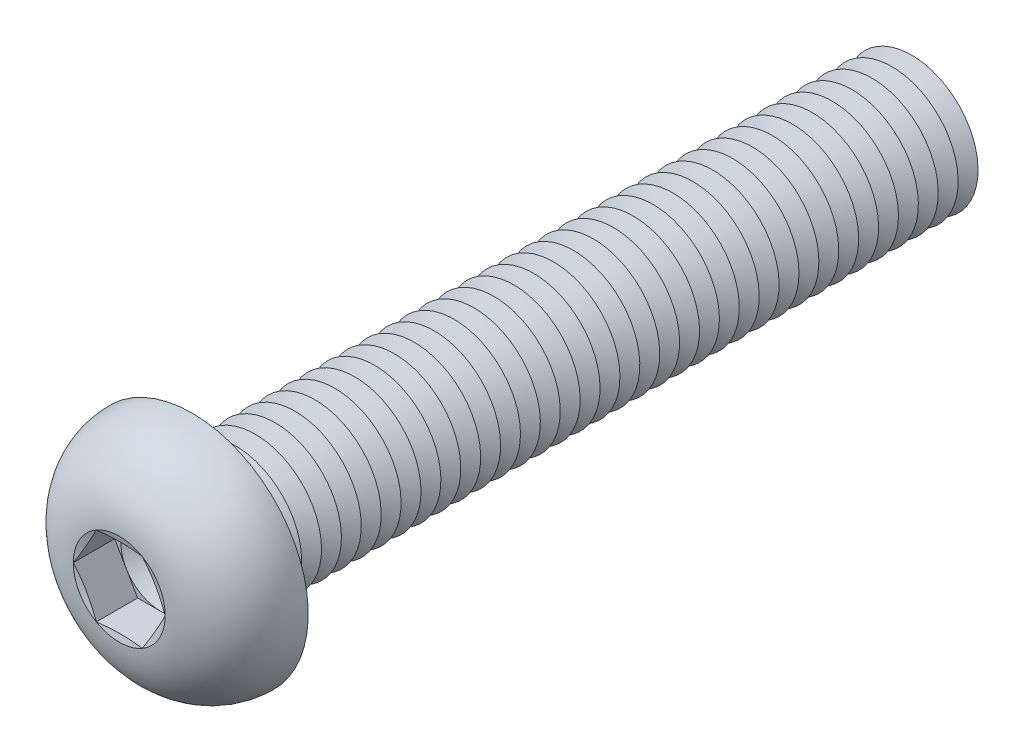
ISO-10303-21;
HEADER;
FILE_DESCRIPTION(('STEP AP214'),'2;1');
FILE_NAME('part.step','',(''),(''),'','','');
FILE_SCHEMA(('AUTOMOTIVE_DESIGN { 1 0 10303 214 1 1 1 1 }'));
ENDSEC;
DATA;
#1=APPLICATION_CONTEXT('core data for automotive mechanical design processes');
#2=APPLICATION_PROTOCOL_DEFINITION('international standard','automotive_design',2000,#1);
#3=PRODUCT_CONTEXT('',#1,'mechanical');
#4=PRODUCT('Part','Part','',(#3));
#5=PRODUCT_RELATED_PRODUCT_CATEGORY('part','',(#4));
#6=PRODUCT_DEFINITION_FORMATION('','',#4);
#7=PRODUCT_DEFINITION_CONTEXT('part definition',#1,'design');
#8=PRODUCT_DEFINITION('design','',#6,#7);
#9=PRODUCT_DEFINITION_SHAPE('','',#8);
#10=(LENGTH_UNIT() NAMED_UNIT(*) SI_UNIT(.MILLI.,.METRE.));
#11=(NAMED_UNIT(*) PLANE_ANGLE_UNIT() SI_UNIT($,.RADIAN.));
#12=(NAMED_UNIT(*) SI_UNIT($,.STERADIAN.) SOLID_ANGLE_UNIT());
#13=UNCERTAINTY_MEASURE_WITH_UNIT(LENGTH_MEASURE(1.E-05),#10,'distance_accuracy_value','');
#14=(GEOMETRIC_REPRESENTATION_CONTEXT(3) GLOBAL_UNCERTAINTY_ASSIGNED_CONTEXT((#13)) GLOBAL_UNIT_ASSIGNED_CONTEXT((#10,
#11,#12)) REPRESENTATION_CONTEXT('',''));
#15=CARTESIAN_POINT('',(0.,0.,0.));
#16=DIRECTION('',(0.,0.,1.));
#17=DIRECTION('',(1.,0.,0.));
#18=AXIS2_PLACEMENT_3D('',#15,#16,#17);
#19=CARTESIAN_POINT('',(0.,0.,2.38));
#20=DIRECTION('',(0.,0.,1.));
#21=DIRECTION('',(1.,0.,0.));
#22=AXIS2_PLACEMENT_3D('',#19,#20,#21);
#23=PLANE('',#22);
#24=CARTESIAN_POINT('',(0.,0.,2.38));
#25=DIRECTION('',(0.,0.,1.));
#26=DIRECTION('',(1.,0.,0.));
#27=AXIS2_PLACEMENT_3D('',#24,#25,#26);
#28=CIRCLE('',#27,2.99999860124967);
#29=CARTESIAN_POINT('',(2.598075,1.49999930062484,2.38));
#30=VERTEX_POINT('',#29);
#31=CARTESIAN_POINT('',(0.,2.99999860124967,2.38));
#32=VERTEX_POINT('',#31);
#33=EDGE_CURVE('E118',#30,#32,#28,.T.);
#34=ORIENTED_EDGE('',*,*,#33,.F.);
#35=DIRECTION('',(-0.500000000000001,0.866025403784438,0.));
#36=VECTOR('',#35,1.);
#37=CARTESIAN_POINT('',(3.4641,0.,2.38));
#38=LINE('',#37,#36);
#39=CARTESIAN_POINT('',(1.73205,2.99999860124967,2.38));
#40=VERTEX_POINT('',#39);
#41=EDGE_CURVE('E125',#30,#40,#38,.T.);
#42=ORIENTED_EDGE('',*,*,#41,.T.);
#43=DIRECTION('',(-1.,0.,0.));
#44=VECTOR('',#43,1.);
#45=CARTESIAN_POINT('',(1.73205,2.99999860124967,2.38));
#46=LINE('',#45,#44);
#47=EDGE_CURVE('E136',#40,#32,#46,.T.);
#48=ORIENTED_EDGE('',*,*,#47,.T.);
#49=EDGE_LOOP('',(#34,#42,#48));
#50=FACE_BOUND('',#49,.T.);
#51=ADVANCED_FACE('F39',(#50),#23,.T.);
#52=CARTESIAN_POINT('',(0.,0.,2.38));
#53=DIRECTION('',(0.,0.,1.));
#54=DIRECTION('',(1.,0.,0.));
#55=AXIS2_PLACEMENT_3D('',#52,#53,#54);
#56=CIRCLE('',#55,2.99999860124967);
#57=CARTESIAN_POINT('',(-2.598075,1.49999930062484,2.38));
#58=VERTEX_POINT('',#57);
#59=EDGE_CURVE('E11',#32,#58,#56,.T.);
#60=ORIENTED_EDGE('',*,*,#59,.F.);
#61=CARTESIAN_POINT('',(-1.73205,2.99999860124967,2.38));
#62=VERTEX_POINT('',#61);
#63=EDGE_CURVE('E131',#32,#62,#46,.T.);
#64=ORIENTED_EDGE('',*,*,#63,.T.);
#65=DIRECTION('',(-0.5,-0.866025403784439,0.));
#66=VECTOR('',#65,1.);
#67=CARTESIAN_POINT('',(-1.73205,2.99999860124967,2.38));
#68=LINE('',#67,#66);
#69=EDGE_CURVE('E134',#62,#58,#68,.T.);
#70=ORIENTED_EDGE('',*,*,#69,.T.);
#71=EDGE_LOOP('',(#60,#64,#70));
#72=FACE_BOUND('',#71,.T.);
#73=ADVANCED_FACE('F130',(#72),#23,.T.);
#74=CARTESIAN_POINT('',(-2.598075,-1.49999930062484,2.38));
#75=VERTEX_POINT('',#74);
#76=EDGE_CURVE('E49',#58,#75,#56,.T.);
#77=ORIENTED_EDGE('',*,*,#76,.F.);
#78=CARTESIAN_POINT('',(-3.4641,0.,2.38));
#79=VERTEX_POINT('',#78);
#80=EDGE_CURVE('E143',#58,#79,#68,.T.);
#81=ORIENTED_EDGE('',*,*,#80,.T.);
#82=DIRECTION('',(0.5,-0.866025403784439,0.));
#83=VECTOR('',#82,1.);
#84=CARTESIAN_POINT('',(-3.4641,0.,2.38));
#85=LINE('',#84,#83);
#86=EDGE_CURVE('E151',#79,#75,#85,.T.);
#87=ORIENTED_EDGE('',*,*,#86,.T.);
#88=EDGE_LOOP('',(#77,#81,#87));
#89=FACE_BOUND('',#88,.T.);
#90=ADVANCED_FACE('F511',(#89),#23,.T.);
#91=CARTESIAN_POINT('',(0.,-2.99999860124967,2.38));
#92=VERTEX_POINT('',#91);
#93=EDGE_CURVE('E497',#75,#92,#56,.T.);
#94=ORIENTED_EDGE('',*,*,#93,.F.);
#95=CARTESIAN_POINT('',(-1.73205,-2.99999860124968,2.38));
#96=VERTEX_POINT('',#95);
#97=EDGE_CURVE('E150',#75,#96,#85,.T.);
#98=ORIENTED_EDGE('',*,*,#97,.T.);
#99=DIRECTION('',(1.,0.,0.));
#100=VECTOR('',#99,1.);
#101=CARTESIAN_POINT('',(-1.73205,-2.99999860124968,2.38));
#102=LINE('',#101,#100);
#103=EDGE_CURVE('E156',#96,#92,#102,.T.);
#104=ORIENTED_EDGE('',*,*,#103,.T.);
#105=EDGE_LOOP('',(#94,#98,#104));
#106=FACE_BOUND('',#105,.T.);
#107=ADVANCED_FACE('F506',(#106),#23,.T.);
#108=CARTESIAN_POINT('',(2.598075,-1.49999930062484,2.38));
#109=VERTEX_POINT('',#108);
#110=EDGE_CURVE('E56',#92,#109,#56,.T.);
#111=ORIENTED_EDGE('',*,*,#110,.F.);
#112=CARTESIAN_POINT('',(1.73205,-2.99999860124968,2.38));
#113=VERTEX_POINT('',#112);
#114=EDGE_CURVE('E155',#92,#113,#102,.T.);
#115=ORIENTED_EDGE('',*,*,#114,.T.);
#116=DIRECTION('',(0.5,0.866025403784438,0.));
#117=VECTOR('',#116,1.);
#118=CARTESIAN_POINT('',(1.73205,-2.99999860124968,2.38));
#119=LINE('',#118,#117);
#120=EDGE_CURVE('E161',#113,#109,#119,.T.);
#121=ORIENTED_EDGE('',*,*,#120,.T.);
#122=EDGE_LOOP('',(#111,#115,#121));
#123=FACE_BOUND('',#122,.T.);
#124=ADVANCED_FACE('F567',(#123),#23,.T.);
#125=CARTESIAN_POINT('',(0.,0.,5.5));
#126=DIRECTION('',(0.,0.,1.));
#127=DIRECTION('',(0.,-1.,0.));
#128=AXIS2_PLACEMENT_3D('',#125,#126,#127);
#129=CONICAL_SURFACE('',#128,3.4641,1.30899693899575);
#130=CARTESIAN_POINT('',(3.46421547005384,-0.000200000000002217,5.50003094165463));
#131=CARTESIAN_POINT('',(3.39227822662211,0.124398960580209,5.48074619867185));
#132=CARTESIAN_POINT('',(3.32021054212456,0.249223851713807,5.46323875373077));
#133=CARTESIAN_POINT('',(3.17582062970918,0.499314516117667,5.43247971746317));
#134=CARTESIAN_POINT('',(3.10349831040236,0.624580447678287,5.41922985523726));
#135=CARTESIAN_POINT('',(2.95903767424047,0.874793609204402,5.39775958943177));
#136=CARTESIAN_POINT('',(2.88690033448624,0.999739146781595,5.38951357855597));
#137=CARTESIAN_POINT('',(2.74253364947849,1.2497895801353,5.37845651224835));
#138=CARTESIAN_POINT('',(2.67030432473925,1.37489444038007,5.37564440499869));
#139=CARTESIAN_POINT('',(2.52584567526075,1.6251041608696,5.37564440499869));
#140=CARTESIAN_POINT('',(2.45361635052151,1.75020902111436,5.37845651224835));
#141=CARTESIAN_POINT('',(2.30924966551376,2.00025945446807,5.38951357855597));
#142=CARTESIAN_POINT('',(2.23711232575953,2.12520499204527,5.39775958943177));
#143=CARTESIAN_POINT('',(2.09265168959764,2.37541815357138,5.41922985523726));
#144=CARTESIAN_POINT('',(2.02032937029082,2.500684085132,5.43247971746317));
#145=CARTESIAN_POINT('',(1.87593945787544,2.75077474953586,5.46323875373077));
#146=CARTESIAN_POINT('',(1.80387177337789,2.87559964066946,5.48074619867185));
#147=CARTESIAN_POINT('',(1.73193452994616,3.00019860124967,5.50003094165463));
#148=B_SPLINE_CURVE_WITH_KNOTS('',3,(#130,#131,#132,#133,#134,#135,#136,#137,#138,#139,#140,
#141,#142,#143,#144,#145,#146,#147),.UNSPECIFIED.,.F.,.F.,(4,2,2,2,2,2,2,2,4),(0.,
0.435506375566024,0.871189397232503,1.3046235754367,1.7379738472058,2.1713241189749,
2.6047582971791,3.04044131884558,3.4759476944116),.UNSPECIFIED.);
#149=CARTESIAN_POINT('',(3.4641,0.,5.5));
#150=VERTEX_POINT('',#149);
#151=CARTESIAN_POINT('',(1.73204999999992,2.99999860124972,5.5));
#152=VERTEX_POINT('',#151);
#153=EDGE_CURVE('E228',#150,#152,#148,.T.);
#154=ORIENTED_EDGE('',*,*,#153,.F.);
#155=CARTESIAN_POINT('',(0.,0.,5.5));
#156=DIRECTION('',(0.,0.,-1.));
#157=DIRECTION('',(0.,1.,0.));
#158=AXIS2_PLACEMENT_3D('',#155,#156,#157);
#159=CIRCLE('',#158,3.4641);
#160=EDGE_CURVE('E307',#152,#150,#159,.T.);
#161=ORIENTED_EDGE('',*,*,#160,.F.);
#162=EDGE_LOOP('',(#154,#161));
#163=FACE_BOUND('',#162,.T.);
#164=ADVANCED_FACE('F527',(#163),#129,.F.);
#165=CARTESIAN_POINT('',(1.73193452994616,-3.00019860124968,5.50003094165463));
#166=CARTESIAN_POINT('',(1.80387177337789,-2.87559964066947,5.48074619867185));
#167=CARTESIAN_POINT('',(1.87593945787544,-2.75077474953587,5.46323875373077));
#168=CARTESIAN_POINT('',(2.02032937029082,-2.50068408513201,5.43247971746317));
#169=CARTESIAN_POINT('',(2.09265168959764,-2.37541815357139,5.41922985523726));
#170=CARTESIAN_POINT('',(2.23711232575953,-2.12520499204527,5.39775958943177));
#171=CARTESIAN_POINT('',(2.30924966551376,-2.00025945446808,5.38951357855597));
#172=CARTESIAN_POINT('',(2.45361635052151,-1.75020902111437,5.37845651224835));
#173=CARTESIAN_POINT('',(2.52584567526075,-1.6251041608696,5.37564440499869));
#174=CARTESIAN_POINT('',(2.67030432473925,-1.37489444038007,5.37564440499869));
#175=CARTESIAN_POINT('',(2.74253364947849,-1.24978958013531,5.37845651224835));
#176=CARTESIAN_POINT('',(2.88690033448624,-0.999739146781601,5.38951357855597));
#177=CARTESIAN_POINT('',(2.95903767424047,-0.874793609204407,5.39775958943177));
#178=CARTESIAN_POINT('',(3.10349831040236,-0.624580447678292,5.41922985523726));
#179=CARTESIAN_POINT('',(3.17582062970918,-0.499314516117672,5.43247971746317));
#180=CARTESIAN_POINT('',(3.32021054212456,-0.249223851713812,5.46323875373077));
#181=CARTESIAN_POINT('',(3.39227822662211,-0.124398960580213,5.48074619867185));
#182=CARTESIAN_POINT('',(3.46421547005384,0.000199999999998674,5.50003094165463));
#183=B_SPLINE_CURVE_WITH_KNOTS('',3,(#165,#166,#167,#168,#169,#170,#171,#172,#173,#174,#175,
#176,#177,#178,#179,#180,#181,#182),.UNSPECIFIED.,.F.,.F.,(4,2,2,2,2,2,2,2,4),(0.,
0.435506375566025,0.871189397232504,1.3046235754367,1.7379738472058,2.1713241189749,
2.6047582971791,3.04044131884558,3.4759476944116),.UNSPECIFIED.);
#184=CARTESIAN_POINT('',(1.73205,-2.99999860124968,5.5));
#185=VERTEX_POINT('',#184);
#186=EDGE_CURVE('E231',#185,#150,#183,.T.);
#187=ORIENTED_EDGE('',*,*,#186,.F.);
#188=EDGE_CURVE('E290',#150,#185,#159,.T.);
#189=ORIENTED_EDGE('',*,*,#188,.F.);
#190=EDGE_LOOP('',(#187,#189));
#191=FACE_BOUND('',#190,.T.);
#192=ADVANCED_FACE('F288',(#191),#129,.F.);
#193=CARTESIAN_POINT('',(-5.2273006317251,-2.99999860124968,6.18672552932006));
#194=CARTESIAN_POINT('',(-5.10075887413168,-2.99999860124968,6.1573201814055));
#195=CARTESIAN_POINT('',(-4.97415993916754,-2.99999860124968,6.12816064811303));
#196=CARTESIAN_POINT('',(-4.72082394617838,-2.99999860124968,6.07043857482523));
#197=CARTESIAN_POINT('',(-4.59408688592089,-2.99999860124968,6.04187604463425));
#198=CARTESIAN_POINT('',(-4.21358997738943,-2.99999860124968,5.95723252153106));
#199=CARTESIAN_POINT('',(-3.95959339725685,-2.99999860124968,5.90220706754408));
#200=CARTESIAN_POINT('',(-3.44835573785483,-2.99999860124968,5.79574115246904));
#201=CARTESIAN_POINT('',(-3.19110656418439,-2.99999860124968,5.744339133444));
#202=CARTESIAN_POINT('',(-2.67540790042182,-2.99999860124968,5.64772994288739));
#203=CARTESIAN_POINT('',(-2.41695830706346,-2.99999860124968,5.60252331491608));
#204=CARTESIAN_POINT('',(-1.9055512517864,-2.99999860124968,5.52251897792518));
#205=CARTESIAN_POINT('',(-1.65263426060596,-2.99999860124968,5.48747285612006));
#206=CARTESIAN_POINT('',(-1.27220564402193,-2.99999860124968,5.44439602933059));
#207=CARTESIAN_POINT('',(-1.1452320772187,-2.99999860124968,5.43161987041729));
#208=CARTESIAN_POINT('',(-0.890973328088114,-2.99999860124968,5.40972605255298));
#209=CARTESIAN_POINT('',(-0.763688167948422,-2.99999860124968,5.40060814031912));
#210=CARTESIAN_POINT('',(-0.509442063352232,-2.99999860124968,5.38647457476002));
#211=CARTESIAN_POINT('',(-0.382482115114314,-2.99999860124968,5.38144125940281));
#212=CARTESIAN_POINT('',(-0.128463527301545,-2.99999860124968,5.37566637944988));
#213=CARTESIAN_POINT('',(-0.0014048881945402,-2.99999860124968,5.37492479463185));
#214=CARTESIAN_POINT('',(0.252672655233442,-2.99999860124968,5.37777315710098));
#215=CARTESIAN_POINT('',(0.379691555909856,-2.99999860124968,5.38136342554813));
#216=CARTESIAN_POINT('',(0.633540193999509,-2.99999860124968,5.39268816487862));
#217=CARTESIAN_POINT('',(0.76036993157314,-2.99999860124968,5.40042263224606));
#218=CARTESIAN_POINT('',(1.06836981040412,-2.99999860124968,5.42382465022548));
#219=CARTESIAN_POINT('',(1.24938929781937,-2.99999860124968,5.4414748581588));
#220=CARTESIAN_POINT('',(1.61066786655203,-2.99999860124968,5.48312309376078));
#221=CARTESIAN_POINT('',(1.7909269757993,-2.99999860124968,5.50712088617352));
#222=CARTESIAN_POINT('',(2.15127612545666,-2.99999860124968,5.56013471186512));
#223=CARTESIAN_POINT('',(2.33136383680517,-2.99999860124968,5.58916634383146));
#224=CARTESIAN_POINT('',(2.690892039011,-2.99999860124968,5.65100028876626));
#225=CARTESIAN_POINT('',(2.87033249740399,-2.99999860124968,5.6838027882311));
#226=CARTESIAN_POINT('',(3.23235399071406,-2.99999860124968,5.75295369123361));
#227=CARTESIAN_POINT('',(3.4149236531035,-2.99999860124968,5.78936117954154));
#228=CARTESIAN_POINT('',(3.77960351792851,-2.99999860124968,5.86440648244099));
#229=CARTESIAN_POINT('',(3.96171371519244,-2.99999860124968,5.903044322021));
#230=CARTESIAN_POINT('',(4.32457472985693,-2.99999860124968,5.98179660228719));
#231=CARTESIAN_POINT('',(4.5053275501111,-2.99999860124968,6.02190185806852));
#232=CARTESIAN_POINT('',(4.86652484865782,-2.99999860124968,6.10342152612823));
#233=CARTESIAN_POINT('',(5.04696934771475,-2.99999860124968,6.14483584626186));
#234=CARTESIAN_POINT('',(5.2273006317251,-2.99999860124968,6.18672552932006));
#235=B_SPLINE_CURVE_WITH_KNOTS('',3,(#193,#194,#195,#196,#197,#198,#199,#200,#201,#202,#203,
#204,#205,#206,#207,#208,#209,#210,#211,#212,#213,#214,#215,#216,#217,#218,#219,#220,#221,#222,
#223,#224,#225,#226,#227,#228,#229,#230,#231,#232,#233,#234),.UNSPECIFIED.,.F.,.F.,(4,2,2,2,2,2,
2,2,2,2,2,2,2,2,2,2,2,2,2,2,4),(0.,0.389739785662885,0.779485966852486,1.5591292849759,
2.34608117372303,3.13310206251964,3.8988410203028,4.28164148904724,4.66441544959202,
5.04552531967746,5.42663339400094,5.80776972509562,6.18890573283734,6.73438998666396,
7.27985402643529,7.8270395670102,8.37425218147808,8.93272720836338,9.49120849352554,
10.0466490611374,10.6020506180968),.UNSPECIFIED.);
#236=CARTESIAN_POINT('',(-1.73205,-2.99999860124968,5.5));
#237=VERTEX_POINT('',#236);
#238=EDGE_CURVE('E241',#237,#185,#235,.T.);
#239=ORIENTED_EDGE('',*,*,#238,.F.);
#240=EDGE_CURVE('E295',#185,#237,#159,.T.);
#241=ORIENTED_EDGE('',*,*,#240,.F.);
#242=EDGE_LOOP('',(#239,#241));
#243=FACE_BOUND('',#242,.T.);
#244=ADVANCED_FACE('F296',(#243),#129,.F.);
#245=CARTESIAN_POINT('',(-3.46421547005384,0.00019999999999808,5.50003094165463));
#246=CARTESIAN_POINT('',(-3.39227822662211,-0.124398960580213,5.48074619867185));
#247=CARTESIAN_POINT('',(-3.32021054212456,-0.249223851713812,5.46323875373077));
#248=CARTESIAN_POINT('',(-3.17582062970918,-0.499314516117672,5.43247971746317));
#249=CARTESIAN_POINT('',(-3.10349831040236,-0.624580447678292,5.41922985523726));
#250=CARTESIAN_POINT('',(-2.95903767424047,-0.874793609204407,5.39775958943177));
#251=CARTESIAN_POINT('',(-2.88690033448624,-0.999739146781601,5.38951357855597));
#252=CARTESIAN_POINT('',(-2.74253364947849,-1.24978958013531,5.37845651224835));
#253=CARTESIAN_POINT('',(-2.67030432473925,-1.37489444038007,5.37564440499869));
#254=CARTESIAN_POINT('',(-2.52584567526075,-1.6251041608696,5.37564440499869));
#255=CARTESIAN_POINT('',(-2.45361635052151,-1.75020902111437,5.37845651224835));
#256=CARTESIAN_POINT('',(-2.30924966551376,-2.00025945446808,5.38951357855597));
#257=CARTESIAN_POINT('',(-2.23711232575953,-2.12520499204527,5.39775958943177));
#258=CARTESIAN_POINT('',(-2.09265168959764,-2.37541815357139,5.41922985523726));
#259=CARTESIAN_POINT('',(-2.02032937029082,-2.50068408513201,5.43247971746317));
#260=CARTESIAN_POINT('',(-1.87593945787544,-2.75077474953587,5.46323875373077));
#261=CARTESIAN_POINT('',(-1.80387177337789,-2.87559964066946,5.48074619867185));
#262=CARTESIAN_POINT('',(-1.73193452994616,-3.00019860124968,5.50003094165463));
#263=B_SPLINE_CURVE_WITH_KNOTS('',3,(#245,#246,#247,#248,#249,#250,#251,#252,#253,#254,#255,
#256,#257,#258,#259,#260,#261,#262),.UNSPECIFIED.,.F.,.F.,(4,2,2,2,2,2,2,2,4),(0.,
0.435506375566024,0.871189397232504,1.3046235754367,1.7379738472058,2.1713241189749,
2.6047582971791,3.04044131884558,3.4759476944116),.UNSPECIFIED.);
#264=CARTESIAN_POINT('',(-3.4641,0.,5.5));
#265=VERTEX_POINT('',#264);
#266=EDGE_CURVE('E236',#265,#237,#263,.T.);
#267=ORIENTED_EDGE('',*,*,#266,.F.);
#268=EDGE_CURVE('E301',#237,#265,#159,.T.);
#269=ORIENTED_EDGE('',*,*,#268,.F.);
#270=EDGE_LOOP('',(#267,#269));
#271=FACE_BOUND('',#270,.T.);
#272=ADVANCED_FACE('F518',(#271),#129,.F.);
#273=CARTESIAN_POINT('',(-1.73193452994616,3.00019860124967,5.50003094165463));
#274=CARTESIAN_POINT('',(-1.8038717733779,2.87559964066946,5.48074619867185));
#275=CARTESIAN_POINT('',(-1.87593945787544,2.75077474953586,5.46323875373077));
#276=CARTESIAN_POINT('',(-2.02032937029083,2.500684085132,5.43247971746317));
#277=CARTESIAN_POINT('',(-2.09265168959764,2.37541815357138,5.41922985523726));
#278=CARTESIAN_POINT('',(-2.23711232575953,2.12520499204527,5.39775958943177));
#279=CARTESIAN_POINT('',(-2.30924966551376,2.00025945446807,5.38951357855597));
#280=CARTESIAN_POINT('',(-2.45361635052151,1.75020902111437,5.37845651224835));
#281=CARTESIAN_POINT('',(-2.52584567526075,1.6251041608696,5.37564440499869));
#282=CARTESIAN_POINT('',(-2.67030432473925,1.37489444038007,5.37564440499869));
#283=CARTESIAN_POINT('',(-2.74253364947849,1.2497895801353,5.37845651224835));
#284=CARTESIAN_POINT('',(-2.88690033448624,0.999739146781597,5.38951357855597));
#285=CARTESIAN_POINT('',(-2.95903767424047,0.874793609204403,5.39775958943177));
#286=CARTESIAN_POINT('',(-3.10349831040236,0.624580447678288,5.41922985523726));
#287=CARTESIAN_POINT('',(-3.17582062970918,0.499314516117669,5.43247971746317));
#288=CARTESIAN_POINT('',(-3.32021054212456,0.249223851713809,5.46323875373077));
#289=CARTESIAN_POINT('',(-3.39227822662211,0.12439896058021,5.48074619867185));
#290=CARTESIAN_POINT('',(-3.46421547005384,-0.000200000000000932,5.50003094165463));
#291=B_SPLINE_CURVE_WITH_KNOTS('',3,(#273,#274,#275,#276,#277,#278,#279,#280,#281,#282,#283,
#284,#285,#286,#287,#288,#289,#290),.UNSPECIFIED.,.F.,.F.,(4,2,2,2,2,2,2,2,4),(0.,
0.435506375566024,0.871189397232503,1.3046235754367,1.7379738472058,2.1713241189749,
2.6047582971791,3.04044131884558,3.4759476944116),.UNSPECIFIED.);
#292=CARTESIAN_POINT('',(-1.73205,2.99999860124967,5.5));
#293=VERTEX_POINT('',#292);
#294=EDGE_CURVE('E233',#293,#265,#291,.T.);
#295=ORIENTED_EDGE('',*,*,#294,.F.);
#296=EDGE_CURVE('E318',#265,#293,#159,.T.);
#297=ORIENTED_EDGE('',*,*,#296,.F.);
#298=EDGE_LOOP('',(#295,#297));
#299=FACE_BOUND('',#298,.T.);
#300=ADVANCED_FACE('F521',(#299),#129,.F.);
#301=CARTESIAN_POINT('',(0.,0.,-49.75));
#302=DIRECTION('',(0.,0.,1.));
#303=DIRECTION('',(0.,-1.,0.));
#304=AXIS2_PLACEMENT_3D('',#301,#302,#303);
#305=CONICAL_SURFACE('',#304,4.99999999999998,1.0471975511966);
#306=CARTESIAN_POINT('',(0.,0.,-50.5));
#307=DIRECTION('',(0.,0.,1.));
#308=DIRECTION('',(0.,-1.,0.));
#309=AXIS2_PLACEMENT_3D('',#306,#307,#308);
#310=CIRCLE('',#309,3.70096189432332);
#311=CARTESIAN_POINT('',(0.,-3.7009618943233,-50.5));
#312=VERTEX_POINT('',#311);
#313=EDGE_CURVE('E454',#312,#312,#310,.T.);
#314=ORIENTED_EDGE('',*,*,#313,.T.);
#315=EDGE_LOOP('',(#314));
#316=FACE_BOUND('',#315,.T.);
#317=CARTESIAN_POINT('',(0.,0.,-49.75));
#318=DIRECTION('',(0.,0.,1.));
#319=DIRECTION('',(0.,-1.,0.));
#320=AXIS2_PLACEMENT_3D('',#317,#318,#319);
#321=CIRCLE('',#320,4.99999999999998);
#322=CARTESIAN_POINT('',(0.,-4.99999999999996,-49.75));
#323=VERTEX_POINT('',#322);
#324=EDGE_CURVE('E450',#323,#323,#321,.T.);
#325=ORIENTED_EDGE('',*,*,#324,.F.);
#326=EDGE_LOOP('',(#325));
#327=FACE_BOUND('',#326,.T.);
#328=ADVANCED_FACE('F622',(#316,#327),#305,.T.);
#329=CARTESIAN_POINT('',(0.,0.,-50.5));
#330=DIRECTION('',(0.,0.,-1.));
#331=DIRECTION('',(0.,1.,0.));
#332=AXIS2_PLACEMENT_3D('',#329,#330,#331);
#333=CONICAL_SURFACE('',#332,3.70096189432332,1.0471975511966);
#334=CARTESIAN_POINT('',(0.,0.,-51.25));
#335=DIRECTION('',(0.,0.,1.));
#336=DIRECTION('',(0.,-1.,0.));
#337=AXIS2_PLACEMENT_3D('',#334,#335,#336);
#338=CIRCLE('',#337,4.99999999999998);
#339=CARTESIAN_POINT('',(0.,-4.99999999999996,-51.25));
#340=VERTEX_POINT('',#339);
#341=EDGE_CURVE('E458',#340,#340,#338,.T.);
#342=ORIENTED_EDGE('',*,*,#341,.T.);
#343=EDGE_LOOP('',(#342));
#344=FACE_BOUND('',#343,.T.);
#345=ORIENTED_EDGE('',*,*,#313,.F.);
#346=EDGE_LOOP('',(#345));
#347=FACE_BOUND('',#346,.T.);
#348=ADVANCED_FACE('F630',(#344,#347),#333,.T.);
#349=CARTESIAN_POINT('',(0.,4.99999999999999,-55.));
#350=DIRECTION('',(0.,0.,-1.));
#351=DIRECTION('',(0.,1.,0.));
#352=AXIS2_PLACEMENT_3D('',#349,#350,#351);
#353=PLANE('',#352);
#354=CARTESIAN_POINT('',(0.,0.,-55.));
#355=DIRECTION('',(0.,0.,1.));
#356=DIRECTION('',(0.,-1.,0.));
#357=AXIS2_PLACEMENT_3D('',#354,#355,#356);
#358=CIRCLE('',#357,3.70096189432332);
#359=CARTESIAN_POINT('',(0.,-3.70096189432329,-55.));
#360=VERTEX_POINT('',#359);
#361=EDGE_CURVE('E325',#360,#360,#358,.T.);
#362=ORIENTED_EDGE('',*,*,#361,.F.);
#363=EDGE_LOOP('',(#362));
#364=FACE_BOUND('',#363,.T.);
#365=ADVANCED_FACE('F640',(#364),#353,.T.);
#366=CARTESIAN_POINT('',(0.,0.,-54.25));
#367=DIRECTION('',(0.,0.,1.));
#368=DIRECTION('',(0.,-1.,0.));
#369=AXIS2_PLACEMENT_3D('',#366,#367,#368);
#370=CONICAL_SURFACE('',#369,4.99999999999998,1.0471975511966);
#371=ORIENTED_EDGE('',*,*,#361,.T.);
#372=EDGE_LOOP('',(#371));
#373=FACE_BOUND('',#372,.T.);
#374=CARTESIAN_POINT('',(0.,0.,-54.25));
#375=DIRECTION('',(0.,0.,1.));
#376=DIRECTION('',(0.,-1.,0.));
#377=AXIS2_PLACEMENT_3D('',#374,#375,#376);
#378=CIRCLE('',#377,4.99999999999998);
#379=CARTESIAN_POINT('',(0.,-4.99999999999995,-54.25));
#380=VERTEX_POINT('',#379);
#381=EDGE_CURVE('E474',#380,#380,#378,.T.);
#382=ORIENTED_EDGE('',*,*,#381,.F.);
#383=EDGE_LOOP('',(#382));
#384=FACE_BOUND('',#383,.T.);
#385=ADVANCED_FACE('F649',(#373,#384),#370,.T.);
#386=CARTESIAN_POINT('',(0.,0.,-53.5));
#387=DIRECTION('',(0.,0.,-1.));
#388=DIRECTION('',(0.,1.,0.));
#389=AXIS2_PLACEMENT_3D('',#386,#387,#388);
#390=CONICAL_SURFACE('',#389,3.70096189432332,1.0471975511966);
#391=ORIENTED_EDGE('',*,*,#381,.T.);
#392=EDGE_LOOP('',(#391));
#393=FACE_BOUND('',#392,.T.);
#394=CARTESIAN_POINT('',(0.,0.,-53.5));
#395=DIRECTION('',(0.,0.,1.));
#396=DIRECTION('',(0.,-1.,0.));
#397=AXIS2_PLACEMENT_3D('',#394,#395,#396);
#398=CIRCLE('',#397,3.70096189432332);
#399=CARTESIAN_POINT('',(0.,-3.7009618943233,-53.5));
#400=VERTEX_POINT('',#399);
#401=EDGE_CURVE('E470',#400,#400,#398,.T.);
#402=ORIENTED_EDGE('',*,*,#401,.F.);
#403=EDGE_LOOP('',(#402));
#404=FACE_BOUND('',#403,.T.);
#405=ADVANCED_FACE('F657',(#393,#404),#390,.T.);
#406=CARTESIAN_POINT('',(0.,0.,-52.75));
#407=DIRECTION('',(0.,0.,1.));
#408=DIRECTION('',(0.,-1.,0.));
#409=AXIS2_PLACEMENT_3D('',#406,#407,#408);
#410=CONICAL_SURFACE('',#409,4.99999999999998,1.0471975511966);
#411=ORIENTED_EDGE('',*,*,#401,.T.);
#412=EDGE_LOOP('',(#411));
#413=FACE_BOUND('',#412,.T.);
#414=CARTESIAN_POINT('',(0.,0.,-52.75));
#415=DIRECTION('',(0.,0.,1.));
#416=DIRECTION('',(0.,-1.,0.));
#417=AXIS2_PLACEMENT_3D('',#414,#415,#416);
#418=CIRCLE('',#417,4.99999999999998);
#419=CARTESIAN_POINT('',(0.,-4.99999999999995,-52.75));
#420=VERTEX_POINT('',#419);
#421=EDGE_CURVE('E466',#420,#420,#418,.T.);
#422=ORIENTED_EDGE('',*,*,#421,.F.);
#423=EDGE_LOOP('',(#422));
#424=FACE_BOUND('',#423,.T.);
#425=ADVANCED_FACE('F666',(#413,#424),#410,.T.);
#426=CARTESIAN_POINT('',(0.,0.,-52.));
#427=DIRECTION('',(0.,0.,-1.));
#428=DIRECTION('',(0.,1.,0.));
#429=AXIS2_PLACEMENT_3D('',#426,#427,#428);
#430=CONICAL_SURFACE('',#429,3.70096189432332,1.0471975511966);
#431=ORIENTED_EDGE('',*,*,#421,.T.);
#432=EDGE_LOOP('',(#431));
#433=FACE_BOUND('',#432,.T.);
#434=CARTESIAN_POINT('',(0.,0.,-52.));
#435=DIRECTION('',(0.,0.,1.));
#436=DIRECTION('',(0.,-1.,0.));
#437=AXIS2_PLACEMENT_3D('',#434,#435,#436);
#438=CIRCLE('',#437,3.70096189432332);
#439=CARTESIAN_POINT('',(0.,-3.7009618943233,-52.));
#440=VERTEX_POINT('',#439);
#441=EDGE_CURVE('E462',#440,#440,#438,.T.);
#442=ORIENTED_EDGE('',*,*,#441,.F.);
#443=EDGE_LOOP('',(#442));
#444=FACE_BOUND('',#443,.T.);
#445=ADVANCED_FACE('F675',(#433,#444),#430,.T.);
#446=CARTESIAN_POINT('',(0.,0.,-51.25));
#447=DIRECTION('',(0.,0.,1.));
#448=DIRECTION('',(0.,-1.,0.));
#449=AXIS2_PLACEMENT_3D('',#446,#447,#448);
#450=CONICAL_SURFACE('',#449,4.99999999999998,1.0471975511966);
#451=ORIENTED_EDGE('',*,*,#441,.T.);
#452=EDGE_LOOP('',(#451));
#453=FACE_BOUND('',#452,.T.);
#454=ORIENTED_EDGE('',*,*,#341,.F.);
#455=EDGE_LOOP('',(#454));
#456=FACE_BOUND('',#455,.T.);
#457=ADVANCED_FACE('F684',(#453,#456),#450,.T.);
#458=CARTESIAN_POINT('',(0.,0.,-48.25));
#459=DIRECTION('',(0.,0.,1.));
#460=DIRECTION('',(0.,-1.,0.));
#461=AXIS2_PLACEMENT_3D('',#458,#459,#460);
#462=CONICAL_SURFACE('',#461,4.99999999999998,1.0471975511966);
#463=CARTESIAN_POINT('',(0.,0.,-49.));
#464=DIRECTION('',(0.,0.,1.));
#465=DIRECTION('',(0.,-1.,0.));
#466=AXIS2_PLACEMENT_3D('',#463,#464,#465);
#467=CIRCLE('',#466,3.70096189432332);
#468=CARTESIAN_POINT('',(0.,-3.7009618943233,-49.));
#469=VERTEX_POINT('',#468);
#470=EDGE_CURVE('E446',#469,#469,#467,.T.);
#471=ORIENTED_EDGE('',*,*,#470,.T.);
#472=EDGE_LOOP('',(#471));
#473=FACE_BOUND('',#472,.T.);
#474=CARTESIAN_POINT('',(0.,0.,-48.25));
#475=DIRECTION('',(0.,0.,1.));
#476=DIRECTION('',(0.,-1.,0.));
#477=AXIS2_PLACEMENT_3D('',#474,#475,#476);
#478=CIRCLE('',#477,4.99999999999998);
#479=CARTESIAN_POINT('',(0.,-4.99999999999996,-48.25));
#480=VERTEX_POINT('',#479);
#481=EDGE_CURVE('E442',#480,#480,#478,.T.);
#482=ORIENTED_EDGE('',*,*,#481,.F.);
#483=EDGE_LOOP('',(#482));
#484=FACE_BOUND('',#483,.T.);
#485=ADVANCED_FACE('F693',(#473,#484),#462,.T.);
#486=CARTESIAN_POINT('',(0.,0.,-49.));
#487=DIRECTION('',(0.,0.,-1.));
#488=DIRECTION('',(0.,1.,0.));
#489=AXIS2_PLACEMENT_3D('',#486,#487,#488);
#490=CONICAL_SURFACE('',#489,3.70096189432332,1.0471975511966);
#491=ORIENTED_EDGE('',*,*,#324,.T.);
#492=EDGE_LOOP('',(#491));
#493=FACE_BOUND('',#492,.T.);
#494=ORIENTED_EDGE('',*,*,#470,.F.);
#495=EDGE_LOOP('',(#494));
#496=FACE_BOUND('',#495,.T.);
#497=ADVANCED_FACE('F702',(#493,#496),#490,.T.);
#498=CARTESIAN_POINT('',(0.,0.,-46.75));
#499=DIRECTION('',(0.,0.,1.));
#500=DIRECTION('',(0.,-1.,0.));
#501=AXIS2_PLACEMENT_3D('',#498,#499,#500);
#502=CONICAL_SURFACE('',#501,4.99999999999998,1.0471975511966);
#503=CARTESIAN_POINT('',(0.,0.,-47.5));
#504=DIRECTION('',(0.,0.,1.));
#505=DIRECTION('',(0.,-1.,0.));
#506=AXIS2_PLACEMENT_3D('',#503,#504,#505);
#507=CIRCLE('',#506,3.70096189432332);
#508=CARTESIAN_POINT('',(0.,-3.7009618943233,-47.5));
#509=VERTEX_POINT('',#508);
#510=EDGE_CURVE('E438',#509,#509,#507,.T.);
#511=ORIENTED_EDGE('',*,*,#510,.T.);
#512=EDGE_LOOP('',(#511));
#513=FACE_BOUND('',#512,.T.);
#514=CARTESIAN_POINT('',(0.,0.,-46.75));
#515=DIRECTION('',(0.,0.,1.));
#516=DIRECTION('',(0.,-1.,0.));
#517=AXIS2_PLACEMENT_3D('',#514,#515,#516);
#518=CIRCLE('',#517,4.99999999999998);
#519=CARTESIAN_POINT('',(0.,-4.99999999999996,-46.75));
#520=VERTEX_POINT('',#519);
#521=EDGE_CURVE('E434',#520,#520,#518,.T.);
#522=ORIENTED_EDGE('',*,*,#521,.F.);
#523=EDGE_LOOP('',(#522));
#524=FACE_BOUND('',#523,.T.);
#525=ADVANCED_FACE('F711',(#513,#524),#502,.T.);
#526=CARTESIAN_POINT('',(0.,0.,-47.5));
#527=DIRECTION('',(0.,0.,-1.));
#528=DIRECTION('',(0.,1.,0.));
#529=AXIS2_PLACEMENT_3D('',#526,#527,#528);
#530=CONICAL_SURFACE('',#529,3.70096189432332,1.0471975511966);
#531=ORIENTED_EDGE('',*,*,#481,.T.);
#532=EDGE_LOOP('',(#531));
#533=FACE_BOUND('',#532,.T.);
#534=ORIENTED_EDGE('',*,*,#510,.F.);
#535=EDGE_LOOP('',(#534));
#536=FACE_BOUND('',#535,.T.);
#537=ADVANCED_FACE('F720',(#533,#536),#530,.T.);
#538=CARTESIAN_POINT('',(0.,0.,-45.25));
#539=DIRECTION('',(0.,0.,1.));
#540=DIRECTION('',(0.,-1.,0.));
#541=AXIS2_PLACEMENT_3D('',#538,#539,#540);
#542=CONICAL_SURFACE('',#541,4.99999999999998,1.0471975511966);
#543=CARTESIAN_POINT('',(0.,0.,-46.));
#544=DIRECTION('',(0.,0.,1.));
#545=DIRECTION('',(0.,-1.,0.));
#546=AXIS2_PLACEMENT_3D('',#543,#544,#545);
#547=CIRCLE('',#546,3.70096189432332);
#548=CARTESIAN_POINT('',(0.,-3.7009618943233,-46.));
#549=VERTEX_POINT('',#548);
#550=EDGE_CURVE('E430',#549,#549,#547,.T.);
#551=ORIENTED_EDGE('',*,*,#550,.T.);
#552=EDGE_LOOP('',(#551));
#553=FACE_BOUND('',#552,.T.);
#554=CARTESIAN_POINT('',(0.,0.,-45.25));
#555=DIRECTION('',(0.,0.,1.));
#556=DIRECTION('',(0.,-1.,0.));
#557=AXIS2_PLACEMENT_3D('',#554,#555,#556);
#558=CIRCLE('',#557,4.99999999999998);
#559=CARTESIAN_POINT('',(0.,-4.99999999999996,-45.25));
#560=VERTEX_POINT('',#559);
#561=EDGE_CURVE('E426',#560,#560,#558,.T.);
#562=ORIENTED_EDGE('',*,*,#561,.F.);
#563=EDGE_LOOP('',(#562));
#564=FACE_BOUND('',#563,.T.);
#565=ADVANCED_FACE('F729',(#553,#564),#542,.T.);
#566=CARTESIAN_POINT('',(0.,0.,-46.));
#567=DIRECTION('',(0.,0.,-1.));
#568=DIRECTION('',(0.,1.,0.));
#569=AXIS2_PLACEMENT_3D('',#566,#567,#568);
#570=CONICAL_SURFACE('',#569,3.70096189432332,1.0471975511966);
#571=ORIENTED_EDGE('',*,*,#521,.T.);
#572=EDGE_LOOP('',(#571));
#573=FACE_BOUND('',#572,.T.);
#574=ORIENTED_EDGE('',*,*,#550,.F.);
#575=EDGE_LOOP('',(#574));
#576=FACE_BOUND('',#575,.T.);
#577=ADVANCED_FACE('F738',(#573,#576),#570,.T.);
#578=CARTESIAN_POINT('',(0.,0.,-43.75));
#579=DIRECTION('',(0.,0.,1.));
#580=DIRECTION('',(0.,-1.,0.));
#581=AXIS2_PLACEMENT_3D('',#578,#579,#580);
#582=CONICAL_SURFACE('',#581,4.99999999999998,1.0471975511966);
#583=CARTESIAN_POINT('',(0.,0.,-44.5));
#584=DIRECTION('',(0.,0.,1.));
#585=DIRECTION('',(0.,-1.,0.));
#586=AXIS2_PLACEMENT_3D('',#583,#584,#585);
#587=CIRCLE('',#586,3.70096189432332);
#588=CARTESIAN_POINT('',(0.,-3.7009618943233,-44.5));
#589=VERTEX_POINT('',#588);
#590=EDGE_CURVE('E422',#589,#589,#587,.T.);
#591=ORIENTED_EDGE('',*,*,#590,.T.);
#592=EDGE_LOOP('',(#591));
#593=FACE_BOUND('',#592,.T.);
#594=CARTESIAN_POINT('',(0.,0.,-43.75));
#595=DIRECTION('',(0.,0.,1.));
#596=DIRECTION('',(0.,-1.,0.));
#597=AXIS2_PLACEMENT_3D('',#594,#595,#596);
#598=CIRCLE('',#597,4.99999999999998);
#599=CARTESIAN_POINT('',(0.,-4.99999999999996,-43.75));
#600=VERTEX_POINT('',#599);
#601=EDGE_CURVE('E418',#600,#600,#598,.T.);
#602=ORIENTED_EDGE('',*,*,#601,.F.);
#603=EDGE_LOOP('',(#602));
#604=FACE_BOUND('',#603,.T.);
#605=ADVANCED_FACE('F747',(#593,#604),#582,.T.);
#606=CARTESIAN_POINT('',(0.,0.,-44.5));
#607=DIRECTION('',(0.,0.,-1.));
#608=DIRECTION('',(0.,1.,0.));
#609=AXIS2_PLACEMENT_3D('',#606,#607,#608);
#610=CONICAL_SURFACE('',#609,3.70096189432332,1.0471975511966);
#611=ORIENTED_EDGE('',*,*,#561,.T.);
#612=EDGE_LOOP('',(#611));
#613=FACE_BOUND('',#612,.T.);
#614=ORIENTED_EDGE('',*,*,#590,.F.);
#615=EDGE_LOOP('',(#614));
#616=FACE_BOUND('',#615,.T.);
#617=ADVANCED_FACE('F756',(#613,#616),#610,.T.);
#618=CARTESIAN_POINT('',(0.,0.,-42.25));
#619=DIRECTION('',(0.,0.,1.));
#620=DIRECTION('',(0.,-1.,0.));
#621=AXIS2_PLACEMENT_3D('',#618,#619,#620);
#622=CONICAL_SURFACE('',#621,4.99999999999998,1.0471975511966);
#623=CARTESIAN_POINT('',(0.,0.,-43.));
#624=DIRECTION('',(0.,0.,1.));
#625=DIRECTION('',(0.,-1.,0.));
#626=AXIS2_PLACEMENT_3D('',#623,#624,#625);
#627=CIRCLE('',#626,3.70096189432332);
#628=CARTESIAN_POINT('',(0.,-3.7009618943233,-43.));
#629=VERTEX_POINT('',#628);
#630=EDGE_CURVE('E414',#629,#629,#627,.T.);
#631=ORIENTED_EDGE('',*,*,#630,.T.);
#632=EDGE_LOOP('',(#631));
#633=FACE_BOUND('',#632,.T.);
#634=CARTESIAN_POINT('',(0.,0.,-42.25));
#635=DIRECTION('',(0.,0.,1.));
#636=DIRECTION('',(0.,-1.,0.));
#637=AXIS2_PLACEMENT_3D('',#634,#635,#636);
#638=CIRCLE('',#637,4.99999999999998);
#639=CARTESIAN_POINT('',(0.,-4.99999999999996,-42.25));
#640=VERTEX_POINT('',#639);
#641=EDGE_CURVE('E410',#640,#640,#638,.T.);
#642=ORIENTED_EDGE('',*,*,#641,.F.);
#643=EDGE_LOOP('',(#642));
#644=FACE_BOUND('',#643,.T.);
#645=ADVANCED_FACE('F765',(#633,#644),#622,.T.);
#646=CARTESIAN_POINT('',(0.,0.,-43.));
#647=DIRECTION('',(0.,0.,-1.));
#648=DIRECTION('',(0.,1.,0.));
#649=AXIS2_PLACEMENT_3D('',#646,#647,#648);
#650=CONICAL_SURFACE('',#649,3.70096189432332,1.0471975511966);
#651=ORIENTED_EDGE('',*,*,#601,.T.);
#652=EDGE_LOOP('',(#651));
#653=FACE_BOUND('',#652,.T.);
#654=ORIENTED_EDGE('',*,*,#630,.F.);
#655=EDGE_LOOP('',(#654));
#656=FACE_BOUND('',#655,.T.);
#657=ADVANCED_FACE('F774',(#653,#656),#650,.T.);
#658=CARTESIAN_POINT('',(0.,0.,-40.75));
#659=DIRECTION('',(0.,0.,1.));
#660=DIRECTION('',(0.,-1.,0.));
#661=AXIS2_PLACEMENT_3D('',#658,#659,#660);
#662=CONICAL_SURFACE('',#661,4.99999999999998,1.0471975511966);
#663=CARTESIAN_POINT('',(0.,0.,-41.5));
#664=DIRECTION('',(0.,0.,1.));
#665=DIRECTION('',(0.,-1.,0.));
#666=AXIS2_PLACEMENT_3D('',#663,#664,#665);
#667=CIRCLE('',#666,3.70096189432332);
#668=CARTESIAN_POINT('',(0.,-3.7009618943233,-41.5));
#669=VERTEX_POINT('',#668);
#670=EDGE_CURVE('E406',#669,#669,#667,.T.);
#671=ORIENTED_EDGE('',*,*,#670,.T.);
#672=EDGE_LOOP('',(#671));
#673=FACE_BOUND('',#672,.T.);
#674=CARTESIAN_POINT('',(0.,0.,-40.75));
#675=DIRECTION('',(0.,0.,1.));
#676=DIRECTION('',(0.,-1.,0.));
#677=AXIS2_PLACEMENT_3D('',#674,#675,#676);
#678=CIRCLE('',#677,4.99999999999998);
#679=CARTESIAN_POINT('',(0.,-4.99999999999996,-40.75));
#680=VERTEX_POINT('',#679);
#681=EDGE_CURVE('E402',#680,#680,#678,.T.);
#682=ORIENTED_EDGE('',*,*,#681,.F.);
#683=EDGE_LOOP('',(#682));
#684=FACE_BOUND('',#683,.T.);
#685=ADVANCED_FACE('F783',(#673,#684),#662,.T.);
#686=CARTESIAN_POINT('',(0.,0.,-41.5));
#687=DIRECTION('',(0.,0.,-1.));
#688=DIRECTION('',(0.,1.,0.));
#689=AXIS2_PLACEMENT_3D('',#686,#687,#688);
#690=CONICAL_SURFACE('',#689,3.70096189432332,1.0471975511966);
#691=ORIENTED_EDGE('',*,*,#641,.T.);
#692=EDGE_LOOP('',(#691));
#693=FACE_BOUND('',#692,.T.);
#694=ORIENTED_EDGE('',*,*,#670,.F.);
#695=EDGE_LOOP('',(#694));
#696=FACE_BOUND('',#695,.T.);
#697=ADVANCED_FACE('F792',(#693,#696),#690,.T.);
#698=CARTESIAN_POINT('',(0.,0.,-39.25));
#699=DIRECTION('',(0.,0.,1.));
#700=DIRECTION('',(0.,-1.,0.));
#701=AXIS2_PLACEMENT_3D('',#698,#699,#700);
#702=CONICAL_SURFACE('',#701,4.99999999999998,1.0471975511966);
#703=CARTESIAN_POINT('',(0.,0.,-40.));
#704=DIRECTION('',(0.,0.,1.));
#705=DIRECTION('',(0.,-1.,0.));
#706=AXIS2_PLACEMENT_3D('',#703,#704,#705);
#707=CIRCLE('',#706,3.70096189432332);
#708=CARTESIAN_POINT('',(0.,-3.7009618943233,-40.));
#709=VERTEX_POINT('',#708);
#710=EDGE_CURVE('E398',#709,#709,#707,.T.);
#711=ORIENTED_EDGE('',*,*,#710,.T.);
#712=EDGE_LOOP('',(#711));
#713=FACE_BOUND('',#712,.T.);
#714=CARTESIAN_POINT('',(0.,0.,-39.25));
#715=DIRECTION('',(0.,0.,1.));
#716=DIRECTION('',(0.,-1.,0.));
#717=AXIS2_PLACEMENT_3D('',#714,#715,#716);
#718=CIRCLE('',#717,4.99999999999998);
#719=CARTESIAN_POINT('',(0.,-4.99999999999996,-39.25));
#720=VERTEX_POINT('',#719);
#721=EDGE_CURVE('E394',#720,#720,#718,.T.);
#722=ORIENTED_EDGE('',*,*,#721,.F.);
#723=EDGE_LOOP('',(#722));
#724=FACE_BOUND('',#723,.T.);
#725=ADVANCED_FACE('F801',(#713,#724),#702,.T.);
#726=CARTESIAN_POINT('',(0.,0.,-40.));
#727=DIRECTION('',(0.,0.,-1.));
#728=DIRECTION('',(0.,1.,0.));
#729=AXIS2_PLACEMENT_3D('',#726,#727,#728);
#730=CONICAL_SURFACE('',#729,3.70096189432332,1.0471975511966);
#731=ORIENTED_EDGE('',*,*,#681,.T.);
#732=EDGE_LOOP('',(#731));
#733=FACE_BOUND('',#732,.T.);
#734=ORIENTED_EDGE('',*,*,#710,.F.);
#735=EDGE_LOOP('',(#734));
#736=FACE_BOUND('',#735,.T.);
#737=ADVANCED_FACE('F810',(#733,#736),#730,.T.);
#738=CARTESIAN_POINT('',(0.,0.,-37.75));
#739=DIRECTION('',(0.,0.,1.));
#740=DIRECTION('',(0.,-1.,0.));
#741=AXIS2_PLACEMENT_3D('',#738,#739,#740);
#742=CONICAL_SURFACE('',#741,4.99999999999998,1.0471975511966);
#743=CARTESIAN_POINT('',(0.,0.,-38.5));
#744=DIRECTION('',(0.,0.,1.));
#745=DIRECTION('',(0.,-1.,0.));
#746=AXIS2_PLACEMENT_3D('',#743,#744,#745);
#747=CIRCLE('',#746,3.70096189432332);
#748=CARTESIAN_POINT('',(0.,-3.7009618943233,-38.5));
#749=VERTEX_POINT('',#748);
#750=EDGE_CURVE('E390',#749,#749,#747,.T.);
#751=ORIENTED_EDGE('',*,*,#750,.T.);
#752=EDGE_LOOP('',(#751));
#753=FACE_BOUND('',#752,.T.);
#754=CARTESIAN_POINT('',(0.,0.,-37.75));
#755=DIRECTION('',(0.,0.,1.));
#756=DIRECTION('',(0.,-1.,0.));
#757=AXIS2_PLACEMENT_3D('',#754,#755,#756);
#758=CIRCLE('',#757,4.99999999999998);
#759=CARTESIAN_POINT('',(0.,-4.99999999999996,-37.75));
#760=VERTEX_POINT('',#759);
#761=EDGE_CURVE('E386',#760,#760,#758,.T.);
#762=ORIENTED_EDGE('',*,*,#761,.F.);
#763=EDGE_LOOP('',(#762));
#764=FACE_BOUND('',#763,.T.);
#765=ADVANCED_FACE('F819',(#753,#764),#742,.T.);
#766=CARTESIAN_POINT('',(0.,0.,-38.5));
#767=DIRECTION('',(0.,0.,-1.));
#768=DIRECTION('',(0.,1.,0.));
#769=AXIS2_PLACEMENT_3D('',#766,#767,#768);
#770=CONICAL_SURFACE('',#769,3.70096189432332,1.0471975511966);
#771=ORIENTED_EDGE('',*,*,#721,.T.);
#772=EDGE_LOOP('',(#771));
#773=FACE_BOUND('',#772,.T.);
#774=ORIENTED_EDGE('',*,*,#750,.F.);
#775=EDGE_LOOP('',(#774));
#776=FACE_BOUND('',#775,.T.);
#777=ADVANCED_FACE('F828',(#773,#776),#770,.T.);
#778=CARTESIAN_POINT('',(0.,0.,-36.25));
#779=DIRECTION('',(0.,0.,1.));
#780=DIRECTION('',(0.,-1.,0.));
#781=AXIS2_PLACEMENT_3D('',#778,#779,#780);
#782=CONICAL_SURFACE('',#781,4.99999999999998,1.0471975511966);
#783=CARTESIAN_POINT('',(0.,0.,-37.));
#784=DIRECTION('',(0.,0.,1.));
#785=DIRECTION('',(0.,-1.,0.));
#786=AXIS2_PLACEMENT_3D('',#783,#784,#785);
#787=CIRCLE('',#786,3.70096189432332);
#788=CARTESIAN_POINT('',(0.,-3.7009618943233,-37.));
#789=VERTEX_POINT('',#788);
#790=EDGE_CURVE('E382',#789,#789,#787,.T.);
#791=ORIENTED_EDGE('',*,*,#790,.T.);
#792=EDGE_LOOP('',(#791));
#793=FACE_BOUND('',#792,.T.);
#794=CARTESIAN_POINT('',(0.,0.,-36.25));
#795=DIRECTION('',(0.,0.,1.));
#796=DIRECTION('',(0.,-1.,0.));
#797=AXIS2_PLACEMENT_3D('',#794,#795,#796);
#798=CIRCLE('',#797,4.99999999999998);
#799=CARTESIAN_POINT('',(0.,-4.99999999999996,-36.25));
#800=VERTEX_POINT('',#799);
#801=EDGE_CURVE('E378',#800,#800,#798,.T.);
#802=ORIENTED_EDGE('',*,*,#801,.F.);
#803=EDGE_LOOP('',(#802));
#804=FACE_BOUND('',#803,.T.);
#805=ADVANCED_FACE('F837',(#793,#804),#782,.T.);
#806=CARTESIAN_POINT('',(0.,0.,-37.));
#807=DIRECTION('',(0.,0.,-1.));
#808=DIRECTION('',(0.,1.,0.));
#809=AXIS2_PLACEMENT_3D('',#806,#807,#808);
#810=CONICAL_SURFACE('',#809,3.70096189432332,1.0471975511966);
#811=ORIENTED_EDGE('',*,*,#761,.T.);
#812=EDGE_LOOP('',(#811));
#813=FACE_BOUND('',#812,.T.);
#814=ORIENTED_EDGE('',*,*,#790,.F.);
#815=EDGE_LOOP('',(#814));
#816=FACE_BOUND('',#815,.T.);
#817=ADVANCED_FACE('F846',(#813,#816),#810,.T.);
#818=CARTESIAN_POINT('',(0.,0.,-34.75));
#819=DIRECTION('',(0.,0.,1.));
#820=DIRECTION('',(0.,-1.,0.));
#821=AXIS2_PLACEMENT_3D('',#818,#819,#820);
#822=CONICAL_SURFACE('',#821,4.99999999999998,1.0471975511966);
#823=CARTESIAN_POINT('',(0.,0.,-35.5));
#824=DIRECTION('',(0.,0.,1.));
#825=DIRECTION('',(0.,-1.,0.));
#826=AXIS2_PLACEMENT_3D('',#823,#824,#825);
#827=CIRCLE('',#826,3.70096189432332);
#828=CARTESIAN_POINT('',(0.,-3.7009618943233,-35.5));
#829=VERTEX_POINT('',#828);
#830=EDGE_CURVE('E374',#829,#829,#827,.T.);
#831=ORIENTED_EDGE('',*,*,#830,.T.);
#832=EDGE_LOOP('',(#831));
#833=FACE_BOUND('',#832,.T.);
#834=CARTESIAN_POINT('',(0.,0.,-34.75));
#835=DIRECTION('',(0.,0.,1.));
#836=DIRECTION('',(0.,-1.,0.));
#837=AXIS2_PLACEMENT_3D('',#834,#835,#836);
#838=CIRCLE('',#837,4.99999999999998);
#839=CARTESIAN_POINT('',(0.,-4.99999999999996,-34.75));
#840=VERTEX_POINT('',#839);
#841=EDGE_CURVE('E370',#840,#840,#838,.T.);
#842=ORIENTED_EDGE('',*,*,#841,.F.);
#843=EDGE_LOOP('',(#842));
#844=FACE_BOUND('',#843,.T.);
#845=ADVANCED_FACE('F855',(#833,#844),#822,.T.);
#846=CARTESIAN_POINT('',(0.,0.,-35.5));
#847=DIRECTION('',(0.,0.,-1.));
#848=DIRECTION('',(0.,1.,0.));
#849=AXIS2_PLACEMENT_3D('',#846,#847,#848);
#850=CONICAL_SURFACE('',#849,3.70096189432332,1.0471975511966);
#851=ORIENTED_EDGE('',*,*,#801,.T.);
#852=EDGE_LOOP('',(#851));
#853=FACE_BOUND('',#852,.T.);
#854=ORIENTED_EDGE('',*,*,#830,.F.);
#855=EDGE_LOOP('',(#854));
#856=FACE_BOUND('',#855,.T.);
#857=ADVANCED_FACE('F864',(#853,#856),#850,.T.);
#858=CARTESIAN_POINT('',(0.,0.,-33.25));
#859=DIRECTION('',(0.,0.,1.));
#860=DIRECTION('',(0.,-1.,0.));
#861=AXIS2_PLACEMENT_3D('',#858,#859,#860);
#862=CONICAL_SURFACE('',#861,4.99999999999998,1.0471975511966);
#863=CARTESIAN_POINT('',(0.,0.,-34.));
#864=DIRECTION('',(0.,0.,1.));
#865=DIRECTION('',(0.,-1.,0.));
#866=AXIS2_PLACEMENT_3D('',#863,#864,#865);
#867=CIRCLE('',#866,3.70096189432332);
#868=CARTESIAN_POINT('',(0.,-3.7009618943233,-34.));
#869=VERTEX_POINT('',#868);
#870=EDGE_CURVE('E366',#869,#869,#867,.T.);
#871=ORIENTED_EDGE('',*,*,#870,.T.);
#872=EDGE_LOOP('',(#871));
#873=FACE_BOUND('',#872,.T.);
#874=CARTESIAN_POINT('',(0.,0.,-33.25));
#875=DIRECTION('',(0.,0.,1.));
#876=DIRECTION('',(0.,-1.,0.));
#877=AXIS2_PLACEMENT_3D('',#874,#875,#876);
#878=CIRCLE('',#877,4.99999999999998);
#879=CARTESIAN_POINT('',(0.,-4.99999999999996,-33.25));
#880=VERTEX_POINT('',#879);
#881=EDGE_CURVE('E362',#880,#880,#878,.T.);
#882=ORIENTED_EDGE('',*,*,#881,.F.);
#883=EDGE_LOOP('',(#882));
#884=FACE_BOUND('',#883,.T.);
#885=ADVANCED_FACE('F873',(#873,#884),#862,.T.);
#886=CARTESIAN_POINT('',(0.,0.,-34.));
#887=DIRECTION('',(0.,0.,-1.));
#888=DIRECTION('',(0.,1.,0.));
#889=AXIS2_PLACEMENT_3D('',#886,#887,#888);
#890=CONICAL_SURFACE('',#889,3.70096189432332,1.0471975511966);
#891=ORIENTED_EDGE('',*,*,#841,.T.);
#892=EDGE_LOOP('',(#891));
#893=FACE_BOUND('',#892,.T.);
#894=ORIENTED_EDGE('',*,*,#870,.F.);
#895=EDGE_LOOP('',(#894));
#896=FACE_BOUND('',#895,.T.);
#897=ADVANCED_FACE('F882',(#893,#896),#890,.T.);
#898=CARTESIAN_POINT('',(0.,0.,-31.75));
#899=DIRECTION('',(0.,0.,1.));
#900=DIRECTION('',(0.,-1.,0.));
#901=AXIS2_PLACEMENT_3D('',#898,#899,#900);
#902=CONICAL_SURFACE('',#901,4.99999999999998,1.0471975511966);
#903=CARTESIAN_POINT('',(0.,0.,-32.5));
#904=DIRECTION('',(0.,0.,1.));
#905=DIRECTION('',(0.,-1.,0.));
#906=AXIS2_PLACEMENT_3D('',#903,#904,#905);
#907=CIRCLE('',#906,3.70096189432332);
#908=CARTESIAN_POINT('',(0.,-3.70096189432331,-32.5));
#909=VERTEX_POINT('',#908);
#910=EDGE_CURVE('E358',#909,#909,#907,.T.);
#911=ORIENTED_EDGE('',*,*,#910,.T.);
#912=EDGE_LOOP('',(#911));
#913=FACE_BOUND('',#912,.T.);
#914=CARTESIAN_POINT('',(0.,0.,-31.75));
#915=DIRECTION('',(0.,0.,1.));
#916=DIRECTION('',(0.,-1.,0.));
#917=AXIS2_PLACEMENT_3D('',#914,#915,#916);
#918=CIRCLE('',#917,4.99999999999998);
#919=CARTESIAN_POINT('',(0.,-4.99999999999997,-31.75));
#920=VERTEX_POINT('',#919);
#921=EDGE_CURVE('E354',#920,#920,#918,.T.);
#922=ORIENTED_EDGE('',*,*,#921,.F.);
#923=EDGE_LOOP('',(#922));
#924=FACE_BOUND('',#923,.T.);
#925=ADVANCED_FACE('F891',(#913,#924),#902,.T.);
#926=CARTESIAN_POINT('',(0.,0.,-32.5));
#927=DIRECTION('',(0.,0.,-1.));
#928=DIRECTION('',(0.,1.,0.));
#929=AXIS2_PLACEMENT_3D('',#926,#927,#928);
#930=CONICAL_SURFACE('',#929,3.70096189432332,1.0471975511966);
#931=ORIENTED_EDGE('',*,*,#881,.T.);
#932=EDGE_LOOP('',(#931));
#933=FACE_BOUND('',#932,.T.);
#934=ORIENTED_EDGE('',*,*,#910,.F.);
#935=EDGE_LOOP('',(#934));
#936=FACE_BOUND('',#935,.T.);
#937=ADVANCED_FACE('F900',(#933,#936),#930,.T.);
#938=CARTESIAN_POINT('',(0.,0.,-30.25));
#939=DIRECTION('',(0.,0.,1.));
#940=DIRECTION('',(0.,-1.,0.));
#941=AXIS2_PLACEMENT_3D('',#938,#939,#940);
#942=CONICAL_SURFACE('',#941,4.99999999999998,1.0471975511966);
#943=CARTESIAN_POINT('',(0.,0.,-31.));
#944=DIRECTION('',(0.,0.,1.));
#945=DIRECTION('',(0.,-1.,0.));
#946=AXIS2_PLACEMENT_3D('',#943,#944,#945);
#947=CIRCLE('',#946,3.70096189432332);
#948=CARTESIAN_POINT('',(0.,-3.70096189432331,-31.));
#949=VERTEX_POINT('',#948);
#950=EDGE_CURVE('E343',#949,#949,#947,.T.);
#951=ORIENTED_EDGE('',*,*,#950,.T.);
#952=EDGE_LOOP('',(#951));
#953=FACE_BOUND('',#952,.T.);
#954=CARTESIAN_POINT('',(0.,0.,-30.25));
#955=DIRECTION('',(0.,0.,1.));
#956=DIRECTION('',(0.,-1.,0.));
#957=AXIS2_PLACEMENT_3D('',#954,#955,#956);
#958=CIRCLE('',#957,4.99999999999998);
#959=CARTESIAN_POINT('',(0.,-4.99999999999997,-30.25));
#960=VERTEX_POINT('',#959);
#961=EDGE_CURVE('E336',#960,#960,#958,.T.);
#962=ORIENTED_EDGE('',*,*,#961,.F.);
#963=EDGE_LOOP('',(#962));
#964=FACE_BOUND('',#963,.T.);
#965=ADVANCED_FACE('F909',(#953,#964),#942,.T.);
#966=CARTESIAN_POINT('',(0.,0.,-31.));
#967=DIRECTION('',(0.,0.,-1.));
#968=DIRECTION('',(0.,1.,0.));
#969=AXIS2_PLACEMENT_3D('',#966,#967,#968);
#970=CONICAL_SURFACE('',#969,3.70096189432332,1.0471975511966);
#971=ORIENTED_EDGE('',*,*,#921,.T.);
#972=EDGE_LOOP('',(#971));
#973=FACE_BOUND('',#972,.T.);
#974=ORIENTED_EDGE('',*,*,#950,.F.);
#975=EDGE_LOOP('',(#974));
#976=FACE_BOUND('',#975,.T.);
#977=ADVANCED_FACE('F918',(#973,#976),#970,.T.);
#978=CARTESIAN_POINT('',(0.,0.,-28.75));
#979=DIRECTION('',(0.,0.,1.));
#980=DIRECTION('',(0.,-1.,0.));
#981=AXIS2_PLACEMENT_3D('',#978,#979,#980);
#982=CONICAL_SURFACE('',#981,4.99999999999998,1.0471975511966);
#983=CARTESIAN_POINT('',(0.,0.,-29.5));
#984=DIRECTION('',(0.,0.,1.));
#985=DIRECTION('',(0.,-1.,0.));
#986=AXIS2_PLACEMENT_3D('',#983,#984,#985);
#987=CIRCLE('',#986,3.70096189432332);
#988=CARTESIAN_POINT('',(0.,-3.70096189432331,-29.5));
#989=VERTEX_POINT('',#988);
#990=EDGE_CURVE('E334',#989,#989,#987,.T.);
#991=ORIENTED_EDGE('',*,*,#990,.T.);
#992=EDGE_LOOP('',(#991));
#993=FACE_BOUND('',#992,.T.);
#994=CARTESIAN_POINT('',(0.,0.,-28.75));
#995=DIRECTION('',(0.,0.,1.));
#996=DIRECTION('',(0.,-1.,0.));
#997=AXIS2_PLACEMENT_3D('',#994,#995,#996);
#998=CIRCLE('',#997,4.99999999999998);
#999=CARTESIAN_POINT('',(0.,-4.99999999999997,-28.75));
#1000=VERTEX_POINT('',#999);
#1001=EDGE_CURVE('E337',#1000,#1000,#998,.T.);
#1002=ORIENTED_EDGE('',*,*,#1001,.F.);
#1003=EDGE_LOOP('',(#1002));
#1004=FACE_BOUND('',#1003,.T.);
#1005=ADVANCED_FACE('F927',(#993,#1004),#982,.T.);
#1006=CARTESIAN_POINT('',(0.,0.,-29.5));
#1007=DIRECTION('',(0.,0.,-1.));
#1008=DIRECTION('',(0.,1.,0.));
#1009=AXIS2_PLACEMENT_3D('',#1006,#1007,#1008);
#1010=CONICAL_SURFACE('',#1009,3.70096189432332,1.0471975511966);
#1011=ORIENTED_EDGE('',*,*,#961,.T.);
#1012=EDGE_LOOP('',(#1011));
#1013=FACE_BOUND('',#1012,.T.);
#1014=ORIENTED_EDGE('',*,*,#990,.F.);
#1015=EDGE_LOOP('',(#1014));
#1016=FACE_BOUND('',#1015,.T.);
#1017=ADVANCED_FACE('F936',(#1013,#1016),#1010,.T.);
#1018=CARTESIAN_POINT('',(0.,0.,-27.25));
#1019=DIRECTION('',(0.,0.,1.));
#1020=DIRECTION('',(0.,-1.,0.));
#1021=AXIS2_PLACEMENT_3D('',#1018,#1019,#1020);
#1022=CONICAL_SURFACE('',#1021,4.99999999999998,1.0471975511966);
#1023=CARTESIAN_POINT('',(0.,0.,-28.));
#1024=DIRECTION('',(0.,0.,1.));
#1025=DIRECTION('',(0.,-1.,0.));
#1026=AXIS2_PLACEMENT_3D('',#1023,#1024,#1025);
#1027=CIRCLE('',#1026,3.70096189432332);
#1028=CARTESIAN_POINT('',(0.,-3.70096189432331,-28.));
#1029=VERTEX_POINT('',#1028);
#1030=EDGE_CURVE('E347',#1029,#1029,#1027,.T.);
#1031=ORIENTED_EDGE('',*,*,#1030,.T.);
#1032=EDGE_LOOP('',(#1031));
#1033=FACE_BOUND('',#1032,.T.);
#1034=CARTESIAN_POINT('',(0.,0.,-27.25));
#1035=DIRECTION('',(0.,0.,1.));
#1036=DIRECTION('',(0.,-1.,0.));
#1037=AXIS2_PLACEMENT_3D('',#1034,#1035,#1036);
#1038=CIRCLE('',#1037,4.99999999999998);
#1039=CARTESIAN_POINT('',(0.,-4.99999999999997,-27.25));
#1040=VERTEX_POINT('',#1039);
#1041=EDGE_CURVE('E1614',#1040,#1040,#1038,.T.);
#1042=ORIENTED_EDGE('',*,*,#1041,.F.);
#1043=EDGE_LOOP('',(#1042));
#1044=FACE_BOUND('',#1043,.T.);
#1045=ADVANCED_FACE('F944',(#1033,#1044),#1022,.T.);
#1046=CARTESIAN_POINT('',(0.,0.,-28.));
#1047=DIRECTION('',(0.,0.,-1.));
#1048=DIRECTION('',(0.,1.,0.));
#1049=AXIS2_PLACEMENT_3D('',#1046,#1047,#1048);
#1050=CONICAL_SURFACE('',#1049,3.70096189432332,1.0471975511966);
#1051=ORIENTED_EDGE('',*,*,#1001,.T.);
#1052=EDGE_LOOP('',(#1051));
#1053=FACE_BOUND('',#1052,.T.);
#1054=ORIENTED_EDGE('',*,*,#1030,.F.);
#1055=EDGE_LOOP('',(#1054));
#1056=FACE_BOUND('',#1055,.T.);
#1057=ADVANCED_FACE('F953',(#1053,#1056),#1050,.T.);
#1058=CARTESIAN_POINT('',(0.,0.,-25.75));
#1059=DIRECTION('',(0.,0.,1.));
#1060=DIRECTION('',(0.,-1.,0.));
#1061=AXIS2_PLACEMENT_3D('',#1058,#1059,#1060);
#1062=CONICAL_SURFACE('',#1061,4.99999999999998,1.0471975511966);
#1063=CARTESIAN_POINT('',(0.,0.,-26.5));
#1064=DIRECTION('',(0.,0.,1.));
#1065=DIRECTION('',(0.,-1.,0.));
#1066=AXIS2_PLACEMENT_3D('',#1063,#1064,#1065);
#1067=CIRCLE('',#1066,3.70096189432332);
#1068=CARTESIAN_POINT('',(0.,-3.70096189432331,-26.5));
#1069=VERTEX_POINT('',#1068);
#1070=EDGE_CURVE('E563',#1069,#1069,#1067,.T.);
#1071=ORIENTED_EDGE('',*,*,#1070,.T.);
#1072=EDGE_LOOP('',(#1071));
#1073=FACE_BOUND('',#1072,.T.);
#1074=CARTESIAN_POINT('',(0.,0.,-25.75));
#1075=DIRECTION('',(0.,0.,1.));
#1076=DIRECTION('',(0.,-1.,0.));
#1077=AXIS2_PLACEMENT_3D('',#1074,#1075,#1076);
#1078=CIRCLE('',#1077,4.99999999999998);
#1079=CARTESIAN_POINT('',(0.,-4.99999999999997,-25.75));
#1080=VERTEX_POINT('',#1079);
#1081=EDGE_CURVE('E561',#1080,#1080,#1078,.T.);
#1082=ORIENTED_EDGE('',*,*,#1081,.F.);
#1083=EDGE_LOOP('',(#1082));
#1084=FACE_BOUND('',#1083,.T.);
#1085=ADVANCED_FACE('F962',(#1073,#1084),#1062,.T.);
#1086=CARTESIAN_POINT('',(0.,0.,-26.5));
#1087=DIRECTION('',(0.,0.,-1.));
#1088=DIRECTION('',(0.,1.,0.));
#1089=AXIS2_PLACEMENT_3D('',#1086,#1087,#1088);
#1090=CONICAL_SURFACE('',#1089,3.70096189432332,1.0471975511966);
#1091=ORIENTED_EDGE('',*,*,#1041,.T.);
#1092=EDGE_LOOP('',(#1091));
#1093=FACE_BOUND('',#1092,.T.);
#1094=ORIENTED_EDGE('',*,*,#1070,.F.);
#1095=EDGE_LOOP('',(#1094));
#1096=FACE_BOUND('',#1095,.T.);
#1097=ADVANCED_FACE('F971',(#1093,#1096),#1090,.T.);
#1098=CARTESIAN_POINT('',(0.,0.,-24.25));
#1099=DIRECTION('',(0.,0.,1.));
#1100=DIRECTION('',(0.,-1.,0.));
#1101=AXIS2_PLACEMENT_3D('',#1098,#1099,#1100);
#1102=CONICAL_SURFACE('',#1101,4.99999999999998,1.0471975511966);
#1103=CARTESIAN_POINT('',(0.,0.,-25.));
#1104=DIRECTION('',(0.,0.,1.));
#1105=DIRECTION('',(0.,-1.,0.));
#1106=AXIS2_PLACEMENT_3D('',#1103,#1104,#1105);
#1107=CIRCLE('',#1106,3.70096189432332);
#1108=CARTESIAN_POINT('',(0.,-3.70096189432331,-25.));
#1109=VERTEX_POINT('',#1108);
#1110=EDGE_CURVE('E564',#1109,#1109,#1107,.T.);
#1111=ORIENTED_EDGE('',*,*,#1110,.T.);
#1112=EDGE_LOOP('',(#1111));
#1113=FACE_BOUND('',#1112,.T.);
#1114=CARTESIAN_POINT('',(0.,0.,-24.25));
#1115=DIRECTION('',(0.,0.,1.));
#1116=DIRECTION('',(0.,-1.,0.));
#1117=AXIS2_PLACEMENT_3D('',#1114,#1115,#1116);
#1118=CIRCLE('',#1117,4.99999999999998);
#1119=CARTESIAN_POINT('',(0.,-4.99999999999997,-24.25));
#1120=VERTEX_POINT('',#1119);
#1121=EDGE_CURVE('E1604',#1120,#1120,#1118,.T.);
#1122=ORIENTED_EDGE('',*,*,#1121,.F.);
#1123=EDGE_LOOP('',(#1122));
#1124=FACE_BOUND('',#1123,.T.);
#1125=ADVANCED_FACE('F980',(#1113,#1124),#1102,.T.);
#1126=CARTESIAN_POINT('',(0.,0.,-25.));
#1127=DIRECTION('',(0.,0.,-1.));
#1128=DIRECTION('',(0.,1.,0.));
#1129=AXIS2_PLACEMENT_3D('',#1126,#1127,#1128);
#1130=CONICAL_SURFACE('',#1129,3.70096189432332,1.0471975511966);
#1131=ORIENTED_EDGE('',*,*,#1081,.T.);
#1132=EDGE_LOOP('',(#1131));
#1133=FACE_BOUND('',#1132,.T.);
#1134=ORIENTED_EDGE('',*,*,#1110,.F.);
#1135=EDGE_LOOP('',(#1134));
#1136=FACE_BOUND('',#1135,.T.);
#1137=ADVANCED_FACE('F989',(#1133,#1136),#1130,.T.);
#1138=CARTESIAN_POINT('',(0.,0.,-22.75));
#1139=DIRECTION('',(0.,0.,1.));
#1140=DIRECTION('',(0.,-1.,0.));
#1141=AXIS2_PLACEMENT_3D('',#1138,#1139,#1140);
#1142=CONICAL_SURFACE('',#1141,4.99999999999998,1.0471975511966);
#1143=CARTESIAN_POINT('',(0.,0.,-23.5));
#1144=DIRECTION('',(0.,0.,1.));
#1145=DIRECTION('',(0.,-1.,0.));
#1146=AXIS2_PLACEMENT_3D('',#1143,#1144,#1145);
#1147=CIRCLE('',#1146,3.70096189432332);
#1148=CARTESIAN_POINT('',(0.,-3.70096189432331,-23.5));
#1149=VERTEX_POINT('',#1148);
#1150=EDGE_CURVE('E1600',#1149,#1149,#1147,.T.);
#1151=ORIENTED_EDGE('',*,*,#1150,.T.);
#1152=EDGE_LOOP('',(#1151));
#1153=FACE_BOUND('',#1152,.T.);
#1154=CARTESIAN_POINT('',(0.,0.,-22.75));
#1155=DIRECTION('',(0.,0.,1.));
#1156=DIRECTION('',(0.,-1.,0.));
#1157=AXIS2_PLACEMENT_3D('',#1154,#1155,#1156);
#1158=CIRCLE('',#1157,4.99999999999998);
#1159=CARTESIAN_POINT('',(0.,-4.99999999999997,-22.75));
#1160=VERTEX_POINT('',#1159);
#1161=EDGE_CURVE('E1596',#1160,#1160,#1158,.T.);
#1162=ORIENTED_EDGE('',*,*,#1161,.F.);
#1163=EDGE_LOOP('',(#1162));
#1164=FACE_BOUND('',#1163,.T.);
#1165=ADVANCED_FACE('F998',(#1153,#1164),#1142,.T.);
#1166=CARTESIAN_POINT('',(0.,0.,-23.5));
#1167=DIRECTION('',(0.,0.,-1.));
#1168=DIRECTION('',(0.,1.,0.));
#1169=AXIS2_PLACEMENT_3D('',#1166,#1167,#1168);
#1170=CONICAL_SURFACE('',#1169,3.70096189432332,1.0471975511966);
#1171=ORIENTED_EDGE('',*,*,#1121,.T.);
#1172=EDGE_LOOP('',(#1171));
#1173=FACE_BOUND('',#1172,.T.);
#1174=ORIENTED_EDGE('',*,*,#1150,.F.);
#1175=EDGE_LOOP('',(#1174));
#1176=FACE_BOUND('',#1175,.T.);
#1177=ADVANCED_FACE('F1007',(#1173,#1176),#1170,.T.);
#1178=CARTESIAN_POINT('',(0.,0.,-21.25));
#1179=DIRECTION('',(0.,0.,1.));
#1180=DIRECTION('',(0.,-1.,0.));
#1181=AXIS2_PLACEMENT_3D('',#1178,#1179,#1180);
#1182=CONICAL_SURFACE('',#1181,4.99999999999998,1.0471975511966);
#1183=CARTESIAN_POINT('',(0.,0.,-22.));
#1184=DIRECTION('',(0.,0.,1.));
#1185=DIRECTION('',(0.,-1.,0.));
#1186=AXIS2_PLACEMENT_3D('',#1183,#1184,#1185);
#1187=CIRCLE('',#1186,3.70096189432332);
#1188=CARTESIAN_POINT('',(0.,-3.70096189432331,-22.));
#1189=VERTEX_POINT('',#1188);
#1190=EDGE_CURVE('E1573',#1189,#1189,#1187,.T.);
#1191=ORIENTED_EDGE('',*,*,#1190,.T.);
#1192=EDGE_LOOP('',(#1191));
#1193=FACE_BOUND('',#1192,.T.);
#1194=CARTESIAN_POINT('',(0.,0.,-21.25));
#1195=DIRECTION('',(0.,0.,1.));
#1196=DIRECTION('',(0.,-1.,0.));
#1197=AXIS2_PLACEMENT_3D('',#1194,#1195,#1196);
#1198=CIRCLE('',#1197,4.99999999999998);
#1199=CARTESIAN_POINT('',(0.,-4.99999999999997,-21.25));
#1200=VERTEX_POINT('',#1199);
#1201=EDGE_CURVE('E538',#1200,#1200,#1198,.T.);
#1202=ORIENTED_EDGE('',*,*,#1201,.F.);
#1203=EDGE_LOOP('',(#1202));
#1204=FACE_BOUND('',#1203,.T.);
#1205=ADVANCED_FACE('F1016',(#1193,#1204),#1182,.T.);
#1206=CARTESIAN_POINT('',(0.,0.,-22.));
#1207=DIRECTION('',(0.,0.,-1.));
#1208=DIRECTION('',(0.,1.,0.));
#1209=AXIS2_PLACEMENT_3D('',#1206,#1207,#1208);
#1210=CONICAL_SURFACE('',#1209,3.70096189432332,1.0471975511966);
#1211=ORIENTED_EDGE('',*,*,#1161,.T.);
#1212=EDGE_LOOP('',(#1211));
#1213=FACE_BOUND('',#1212,.T.);
#1214=ORIENTED_EDGE('',*,*,#1190,.F.);
#1215=EDGE_LOOP('',(#1214));
#1216=FACE_BOUND('',#1215,.T.);
#1217=ADVANCED_FACE('F1025',(#1213,#1216),#1210,.T.);
#1218=CARTESIAN_POINT('',(0.,0.,-19.75));
#1219=DIRECTION('',(0.,0.,1.));
#1220=DIRECTION('',(0.,-1.,0.));
#1221=AXIS2_PLACEMENT_3D('',#1218,#1219,#1220);
#1222=CONICAL_SURFACE('',#1221,4.99999999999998,1.0471975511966);
#1223=CARTESIAN_POINT('',(0.,0.,-20.5));
#1224=DIRECTION('',(0.,0.,1.));
#1225=DIRECTION('',(0.,-1.,0.));
#1226=AXIS2_PLACEMENT_3D('',#1223,#1224,#1225);
#1227=CIRCLE('',#1226,3.70096189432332);
#1228=CARTESIAN_POINT('',(0.,-3.70096189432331,-20.5));
#1229=VERTEX_POINT('',#1228);
#1230=EDGE_CURVE('E536',#1229,#1229,#1227,.T.);
#1231=ORIENTED_EDGE('',*,*,#1230,.T.);
#1232=EDGE_LOOP('',(#1231));
#1233=FACE_BOUND('',#1232,.T.);
#1234=CARTESIAN_POINT('',(0.,0.,-19.75));
#1235=DIRECTION('',(0.,0.,1.));
#1236=DIRECTION('',(0.,-1.,0.));
#1237=AXIS2_PLACEMENT_3D('',#1234,#1235,#1236);
#1238=CIRCLE('',#1237,4.99999999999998);
#1239=CARTESIAN_POINT('',(0.,-4.99999999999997,-19.75));
#1240=VERTEX_POINT('',#1239);
#1241=EDGE_CURVE('E539',#1240,#1240,#1238,.T.);
#1242=ORIENTED_EDGE('',*,*,#1241,.F.);
#1243=EDGE_LOOP('',(#1242));
#1244=FACE_BOUND('',#1243,.T.);
#1245=ADVANCED_FACE('F1034',(#1233,#1244),#1222,.T.);
#1246=CARTESIAN_POINT('',(0.,0.,-20.5));
#1247=DIRECTION('',(0.,0.,-1.));
#1248=DIRECTION('',(0.,1.,0.));
#1249=AXIS2_PLACEMENT_3D('',#1246,#1247,#1248);
#1250=CONICAL_SURFACE('',#1249,3.70096189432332,1.0471975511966);
#1251=ORIENTED_EDGE('',*,*,#1201,.T.);
#1252=EDGE_LOOP('',(#1251));
#1253=FACE_BOUND('',#1252,.T.);
#1254=ORIENTED_EDGE('',*,*,#1230,.F.);
#1255=EDGE_LOOP('',(#1254));
#1256=FACE_BOUND('',#1255,.T.);
#1257=ADVANCED_FACE('F1043',(#1253,#1256),#1250,.T.);
#1258=CARTESIAN_POINT('',(0.,0.,-18.25));
#1259=DIRECTION('',(0.,0.,1.));
#1260=DIRECTION('',(0.,-1.,0.));
#1261=AXIS2_PLACEMENT_3D('',#1258,#1259,#1260);
#1262=CONICAL_SURFACE('',#1261,4.99999999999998,1.0471975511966);
#1263=CARTESIAN_POINT('',(0.,0.,-19.));
#1264=DIRECTION('',(0.,0.,1.));
#1265=DIRECTION('',(0.,-1.,0.));
#1266=AXIS2_PLACEMENT_3D('',#1263,#1264,#1265);
#1267=CIRCLE('',#1266,3.70096189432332);
#1268=CARTESIAN_POINT('',(0.,-3.70096189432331,-19.));
#1269=VERTEX_POINT('',#1268);
#1270=EDGE_CURVE('E1558',#1269,#1269,#1267,.T.);
#1271=ORIENTED_EDGE('',*,*,#1270,.T.);
#1272=EDGE_LOOP('',(#1271));
#1273=FACE_BOUND('',#1272,.T.);
#1274=CARTESIAN_POINT('',(0.,0.,-18.25));
#1275=DIRECTION('',(0.,0.,1.));
#1276=DIRECTION('',(0.,-1.,0.));
#1277=AXIS2_PLACEMENT_3D('',#1274,#1275,#1276);
#1278=CIRCLE('',#1277,4.99999999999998);
#1279=CARTESIAN_POINT('',(0.,-4.99999999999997,-18.25));
#1280=VERTEX_POINT('',#1279);
#1281=EDGE_CURVE('E331',#1280,#1280,#1278,.T.);
#1282=ORIENTED_EDGE('',*,*,#1281,.F.);
#1283=EDGE_LOOP('',(#1282));
#1284=FACE_BOUND('',#1283,.T.);
#1285=ADVANCED_FACE('F1052',(#1273,#1284),#1262,.T.);
#1286=CARTESIAN_POINT('',(0.,0.,-19.));
#1287=DIRECTION('',(0.,0.,-1.));
#1288=DIRECTION('',(0.,1.,0.));
#1289=AXIS2_PLACEMENT_3D('',#1286,#1287,#1288);
#1290=CONICAL_SURFACE('',#1289,3.70096189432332,1.0471975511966);
#1291=ORIENTED_EDGE('',*,*,#1241,.T.);
#1292=EDGE_LOOP('',(#1291));
#1293=FACE_BOUND('',#1292,.T.);
#1294=ORIENTED_EDGE('',*,*,#1270,.F.);
#1295=EDGE_LOOP('',(#1294));
#1296=FACE_BOUND('',#1295,.T.);
#1297=ADVANCED_FACE('F1061',(#1293,#1296),#1290,.T.);
#1298=CARTESIAN_POINT('',(0.,0.,-16.75));
#1299=DIRECTION('',(0.,0.,1.));
#1300=DIRECTION('',(0.,-1.,0.));
#1301=AXIS2_PLACEMENT_3D('',#1298,#1299,#1300);
#1302=CONICAL_SURFACE('',#1301,4.99999999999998,1.0471975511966);
#1303=CARTESIAN_POINT('',(0.,0.,-17.5));
#1304=DIRECTION('',(0.,0.,1.));
#1305=DIRECTION('',(0.,-1.,0.));
#1306=AXIS2_PLACEMENT_3D('',#1303,#1304,#1305);
#1307=CIRCLE('',#1306,3.70096189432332);
#1308=CARTESIAN_POINT('',(0.,-3.70096189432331,-17.5));
#1309=VERTEX_POINT('',#1308);
#1310=EDGE_CURVE('E329',#1309,#1309,#1307,.T.);
#1311=ORIENTED_EDGE('',*,*,#1310,.T.);
#1312=EDGE_LOOP('',(#1311));
#1313=FACE_BOUND('',#1312,.T.);
#1314=CARTESIAN_POINT('',(0.,0.,-16.75));
#1315=DIRECTION('',(0.,0.,1.));
#1316=DIRECTION('',(0.,-1.,0.));
#1317=AXIS2_PLACEMENT_3D('',#1314,#1315,#1316);
#1318=CIRCLE('',#1317,4.99999999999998);
#1319=CARTESIAN_POINT('',(0.,-4.99999999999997,-16.75));
#1320=VERTEX_POINT('',#1319);
#1321=EDGE_CURVE('E332',#1320,#1320,#1318,.T.);
#1322=ORIENTED_EDGE('',*,*,#1321,.F.);
#1323=EDGE_LOOP('',(#1322));
#1324=FACE_BOUND('',#1323,.T.);
#1325=ADVANCED_FACE('F1070',(#1313,#1324),#1302,.T.);
#1326=CARTESIAN_POINT('',(0.,0.,-17.5));
#1327=DIRECTION('',(0.,0.,-1.));
#1328=DIRECTION('',(0.,1.,0.));
#1329=AXIS2_PLACEMENT_3D('',#1326,#1327,#1328);
#1330=CONICAL_SURFACE('',#1329,3.70096189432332,1.0471975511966);
#1331=ORIENTED_EDGE('',*,*,#1281,.T.);
#1332=EDGE_LOOP('',(#1331));
#1333=FACE_BOUND('',#1332,.T.);
#1334=ORIENTED_EDGE('',*,*,#1310,.F.);
#1335=EDGE_LOOP('',(#1334));
#1336=FACE_BOUND('',#1335,.T.);
#1337=ADVANCED_FACE('F1079',(#1333,#1336),#1330,.T.);
#1338=CARTESIAN_POINT('',(0.,0.,-15.25));
#1339=DIRECTION('',(0.,0.,1.));
#1340=DIRECTION('',(0.,-1.,0.));
#1341=AXIS2_PLACEMENT_3D('',#1338,#1339,#1340);
#1342=CONICAL_SURFACE('',#1341,4.99999999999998,1.0471975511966);
#1343=CARTESIAN_POINT('',(0.,0.,-16.));
#1344=DIRECTION('',(0.,0.,1.));
#1345=DIRECTION('',(0.,-1.,0.));
#1346=AXIS2_PLACEMENT_3D('',#1343,#1344,#1345);
#1347=CIRCLE('',#1346,3.70096189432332);
#1348=CARTESIAN_POINT('',(0.,-3.70096189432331,-16.));
#1349=VERTEX_POINT('',#1348);
#1350=EDGE_CURVE('E531',#1349,#1349,#1347,.T.);
#1351=ORIENTED_EDGE('',*,*,#1350,.T.);
#1352=EDGE_LOOP('',(#1351));
#1353=FACE_BOUND('',#1352,.T.);
#1354=CARTESIAN_POINT('',(0.,0.,-15.25));
#1355=DIRECTION('',(0.,0.,1.));
#1356=DIRECTION('',(0.,-1.,0.));
#1357=AXIS2_PLACEMENT_3D('',#1354,#1355,#1356);
#1358=CIRCLE('',#1357,4.99999999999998);
#1359=CARTESIAN_POINT('',(0.,-4.99999999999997,-15.25));
#1360=VERTEX_POINT('',#1359);
#1361=EDGE_CURVE('E534',#1360,#1360,#1358,.T.);
#1362=ORIENTED_EDGE('',*,*,#1361,.F.);
#1363=EDGE_LOOP('',(#1362));
#1364=FACE_BOUND('',#1363,.T.);
#1365=ADVANCED_FACE('F1088',(#1353,#1364),#1342,.T.);
#1366=CARTESIAN_POINT('',(0.,0.,-16.));
#1367=DIRECTION('',(0.,0.,-1.));
#1368=DIRECTION('',(0.,1.,0.));
#1369=AXIS2_PLACEMENT_3D('',#1366,#1367,#1368);
#1370=CONICAL_SURFACE('',#1369,3.70096189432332,1.0471975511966);
#1371=ORIENTED_EDGE('',*,*,#1321,.T.);
#1372=EDGE_LOOP('',(#1371));
#1373=FACE_BOUND('',#1372,.T.);
#1374=ORIENTED_EDGE('',*,*,#1350,.F.);
#1375=EDGE_LOOP('',(#1374));
#1376=FACE_BOUND('',#1375,.T.);
#1377=ADVANCED_FACE('F1097',(#1373,#1376),#1370,.T.);
#1378=CARTESIAN_POINT('',(0.,0.,-13.75));
#1379=DIRECTION('',(0.,0.,1.));
#1380=DIRECTION('',(0.,-1.,0.));
#1381=AXIS2_PLACEMENT_3D('',#1378,#1379,#1380);
#1382=CONICAL_SURFACE('',#1381,4.99999999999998,1.0471975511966);
#1383=CARTESIAN_POINT('',(0.,0.,-14.5));
#1384=DIRECTION('',(0.,0.,1.));
#1385=DIRECTION('',(0.,-1.,0.));
#1386=AXIS2_PLACEMENT_3D('',#1383,#1384,#1385);
#1387=CIRCLE('',#1386,3.70096189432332);
#1388=CARTESIAN_POINT('',(0.,-3.70096189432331,-14.5));
#1389=VERTEX_POINT('',#1388);
#1390=EDGE_CURVE('E1579',#1389,#1389,#1387,.T.);
#1391=ORIENTED_EDGE('',*,*,#1390,.T.);
#1392=EDGE_LOOP('',(#1391));
#1393=FACE_BOUND('',#1392,.T.);
#1394=CARTESIAN_POINT('',(0.,0.,-13.75));
#1395=DIRECTION('',(0.,0.,1.));
#1396=DIRECTION('',(0.,-1.,0.));
#1397=AXIS2_PLACEMENT_3D('',#1394,#1395,#1396);
#1398=CIRCLE('',#1397,4.99999999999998);
#1399=CARTESIAN_POINT('',(0.,-4.99999999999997,-13.75));
#1400=VERTEX_POINT('',#1399);
#1401=EDGE_CURVE('E1554',#1400,#1400,#1398,.T.);
#1402=ORIENTED_EDGE('',*,*,#1401,.F.);
#1403=EDGE_LOOP('',(#1402));
#1404=FACE_BOUND('',#1403,.T.);
#1405=ADVANCED_FACE('F1106',(#1393,#1404),#1382,.T.);
#1406=CARTESIAN_POINT('',(0.,0.,-14.5));
#1407=DIRECTION('',(0.,0.,-1.));
#1408=DIRECTION('',(0.,1.,0.));
#1409=AXIS2_PLACEMENT_3D('',#1406,#1407,#1408);
#1410=CONICAL_SURFACE('',#1409,3.70096189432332,1.0471975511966);
#1411=ORIENTED_EDGE('',*,*,#1361,.T.);
#1412=EDGE_LOOP('',(#1411));
#1413=FACE_BOUND('',#1412,.T.);
#1414=ORIENTED_EDGE('',*,*,#1390,.F.);
#1415=EDGE_LOOP('',(#1414));
#1416=FACE_BOUND('',#1415,.T.);
#1417=ADVANCED_FACE('F1115',(#1413,#1416),#1410,.T.);
#1418=CARTESIAN_POINT('',(0.,0.,-12.25));
#1419=DIRECTION('',(0.,0.,1.));
#1420=DIRECTION('',(0.,-1.,0.));
#1421=AXIS2_PLACEMENT_3D('',#1418,#1419,#1420);
#1422=CONICAL_SURFACE('',#1421,4.99999999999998,1.0471975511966);
#1423=CARTESIAN_POINT('',(0.,0.,-13.));
#1424=DIRECTION('',(0.,0.,1.));
#1425=DIRECTION('',(0.,-1.,0.));
#1426=AXIS2_PLACEMENT_3D('',#1423,#1424,#1425);
#1427=CIRCLE('',#1426,3.70096189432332);
#1428=CARTESIAN_POINT('',(0.,-3.70096189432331,-13.));
#1429=VERTEX_POINT('',#1428);
#1430=EDGE_CURVE('E1551',#1429,#1429,#1427,.T.);
#1431=ORIENTED_EDGE('',*,*,#1430,.T.);
#1432=EDGE_LOOP('',(#1431));
#1433=FACE_BOUND('',#1432,.T.);
#1434=CARTESIAN_POINT('',(0.,0.,-12.25));
#1435=DIRECTION('',(0.,0.,1.));
#1436=DIRECTION('',(0.,-1.,0.));
#1437=AXIS2_PLACEMENT_3D('',#1434,#1435,#1436);
#1438=CIRCLE('',#1437,4.99999999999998);
#1439=CARTESIAN_POINT('',(0.,-4.99999999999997,-12.25));
#1440=VERTEX_POINT('',#1439);
#1441=EDGE_CURVE('E1555',#1440,#1440,#1438,.T.);
#1442=ORIENTED_EDGE('',*,*,#1441,.F.);
#1443=EDGE_LOOP('',(#1442));
#1444=FACE_BOUND('',#1443,.T.);
#1445=ADVANCED_FACE('F1124',(#1433,#1444),#1422,.T.);
#1446=CARTESIAN_POINT('',(0.,0.,-13.));
#1447=DIRECTION('',(0.,0.,-1.));
#1448=DIRECTION('',(0.,1.,0.));
#1449=AXIS2_PLACEMENT_3D('',#1446,#1447,#1448);
#1450=CONICAL_SURFACE('',#1449,3.70096189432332,1.0471975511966);
#1451=ORIENTED_EDGE('',*,*,#1401,.T.);
#1452=EDGE_LOOP('',(#1451));
#1453=FACE_BOUND('',#1452,.T.);
#1454=ORIENTED_EDGE('',*,*,#1430,.F.);
#1455=EDGE_LOOP('',(#1454));
#1456=FACE_BOUND('',#1455,.T.);
#1457=ADVANCED_FACE('F1133',(#1453,#1456),#1450,.T.);
#1458=CARTESIAN_POINT('',(0.,0.,-10.75));
#1459=DIRECTION('',(0.,0.,1.));
#1460=DIRECTION('',(0.,-1.,0.));
#1461=AXIS2_PLACEMENT_3D('',#1458,#1459,#1460);
#1462=CONICAL_SURFACE('',#1461,4.99999999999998,1.0471975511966);
#1463=CARTESIAN_POINT('',(0.,0.,-11.5));
#1464=DIRECTION('',(0.,0.,1.));
#1465=DIRECTION('',(0.,-1.,0.));
#1466=AXIS2_PLACEMENT_3D('',#1463,#1464,#1465);
#1467=CIRCLE('',#1466,3.70096189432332);
#1468=CARTESIAN_POINT('',(0.,-3.70096189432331,-11.5));
#1469=VERTEX_POINT('',#1468);
#1470=EDGE_CURVE('E1563',#1469,#1469,#1467,.T.);
#1471=ORIENTED_EDGE('',*,*,#1470,.T.);
#1472=EDGE_LOOP('',(#1471));
#1473=FACE_BOUND('',#1472,.T.);
#1474=CARTESIAN_POINT('',(0.,0.,-10.75));
#1475=DIRECTION('',(0.,0.,1.));
#1476=DIRECTION('',(0.,-1.,0.));
#1477=AXIS2_PLACEMENT_3D('',#1474,#1475,#1476);
#1478=CIRCLE('',#1477,4.99999999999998);
#1479=CARTESIAN_POINT('',(0.,-4.99999999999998,-10.75));
#1480=VERTEX_POINT('',#1479);
#1481=EDGE_CURVE('E1561',#1480,#1480,#1478,.T.);
#1482=ORIENTED_EDGE('',*,*,#1481,.F.);
#1483=EDGE_LOOP('',(#1482));
#1484=FACE_BOUND('',#1483,.T.);
#1485=ADVANCED_FACE('F1142',(#1473,#1484),#1462,.T.);
#1486=CARTESIAN_POINT('',(0.,0.,-11.5));
#1487=DIRECTION('',(0.,0.,-1.));
#1488=DIRECTION('',(0.,1.,0.));
#1489=AXIS2_PLACEMENT_3D('',#1486,#1487,#1488);
#1490=CONICAL_SURFACE('',#1489,3.70096189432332,1.0471975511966);
#1491=ORIENTED_EDGE('',*,*,#1441,.T.);
#1492=EDGE_LOOP('',(#1491));
#1493=FACE_BOUND('',#1492,.T.);
#1494=ORIENTED_EDGE('',*,*,#1470,.F.);
#1495=EDGE_LOOP('',(#1494));
#1496=FACE_BOUND('',#1495,.T.);
#1497=ADVANCED_FACE('F1151',(#1493,#1496),#1490,.T.);
#1498=CARTESIAN_POINT('',(0.,0.,-9.24999999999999));
#1499=DIRECTION('',(0.,0.,1.));
#1500=DIRECTION('',(0.,-1.,0.));
#1501=AXIS2_PLACEMENT_3D('',#1498,#1499,#1500);
#1502=CONICAL_SURFACE('',#1501,4.99999999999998,1.0471975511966);
#1503=CARTESIAN_POINT('',(0.,0.,-9.99999999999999));
#1504=DIRECTION('',(0.,0.,1.));
#1505=DIRECTION('',(0.,-1.,0.));
#1506=AXIS2_PLACEMENT_3D('',#1503,#1504,#1505);
#1507=CIRCLE('',#1506,3.70096189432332);
#1508=CARTESIAN_POINT('',(0.,-3.70096189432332,-10.));
#1509=VERTEX_POINT('',#1508);
#1510=EDGE_CURVE('E558',#1509,#1509,#1507,.T.);
#1511=ORIENTED_EDGE('',*,*,#1510,.T.);
#1512=EDGE_LOOP('',(#1511));
#1513=FACE_BOUND('',#1512,.T.);
#1514=CARTESIAN_POINT('',(0.,0.,-9.24999999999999));
#1515=DIRECTION('',(0.,0.,1.));
#1516=DIRECTION('',(0.,-1.,0.));
#1517=AXIS2_PLACEMENT_3D('',#1514,#1515,#1516);
#1518=CIRCLE('',#1517,4.99999999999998);
#1519=CARTESIAN_POINT('',(0.,-4.99999999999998,-9.25));
#1520=VERTEX_POINT('',#1519);
#1521=EDGE_CURVE('E555',#1520,#1520,#1518,.T.);
#1522=ORIENTED_EDGE('',*,*,#1521,.F.);
#1523=EDGE_LOOP('',(#1522));
#1524=FACE_BOUND('',#1523,.T.);
#1525=ADVANCED_FACE('F1160',(#1513,#1524),#1502,.T.);
#1526=CARTESIAN_POINT('',(0.,0.,-9.99999999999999));
#1527=DIRECTION('',(0.,0.,-1.));
#1528=DIRECTION('',(0.,1.,0.));
#1529=AXIS2_PLACEMENT_3D('',#1526,#1527,#1528);
#1530=CONICAL_SURFACE('',#1529,3.70096189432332,1.0471975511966);
#1531=ORIENTED_EDGE('',*,*,#1481,.T.);
#1532=EDGE_LOOP('',(#1531));
#1533=FACE_BOUND('',#1532,.T.);
#1534=ORIENTED_EDGE('',*,*,#1510,.F.);
#1535=EDGE_LOOP('',(#1534));
#1536=FACE_BOUND('',#1535,.T.);
#1537=ADVANCED_FACE('F1169',(#1533,#1536),#1530,.T.);
#1538=CARTESIAN_POINT('',(0.,0.,-7.74999999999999));
#1539=DIRECTION('',(0.,0.,1.));
#1540=DIRECTION('',(0.,-1.,0.));
#1541=AXIS2_PLACEMENT_3D('',#1538,#1539,#1540);
#1542=CONICAL_SURFACE('',#1541,4.99999999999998,1.0471975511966);
#1543=CARTESIAN_POINT('',(0.,0.,-8.49999999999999));
#1544=DIRECTION('',(0.,0.,1.));
#1545=DIRECTION('',(0.,-1.,0.));
#1546=AXIS2_PLACEMENT_3D('',#1543,#1544,#1545);
#1547=CIRCLE('',#1546,3.70096189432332);
#1548=CARTESIAN_POINT('',(0.,-3.70096189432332,-8.49999999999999));
#1549=VERTEX_POINT('',#1548);
#1550=EDGE_CURVE('E559',#1549,#1549,#1547,.T.);
#1551=ORIENTED_EDGE('',*,*,#1550,.T.);
#1552=EDGE_LOOP('',(#1551));
#1553=FACE_BOUND('',#1552,.T.);
#1554=CARTESIAN_POINT('',(0.,0.,-7.74999999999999));
#1555=DIRECTION('',(0.,0.,1.));
#1556=DIRECTION('',(0.,-1.,0.));
#1557=AXIS2_PLACEMENT_3D('',#1554,#1555,#1556);
#1558=CIRCLE('',#1557,4.99999999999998);
#1559=CARTESIAN_POINT('',(0.,-4.99999999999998,-7.75));
#1560=VERTEX_POINT('',#1559);
#1561=EDGE_CURVE('E1569',#1560,#1560,#1558,.T.);
#1562=ORIENTED_EDGE('',*,*,#1561,.F.);
#1563=EDGE_LOOP('',(#1562));
#1564=FACE_BOUND('',#1563,.T.);
#1565=ADVANCED_FACE('F1178',(#1553,#1564),#1542,.T.);
#1566=CARTESIAN_POINT('',(0.,0.,-8.49999999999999));
#1567=DIRECTION('',(0.,0.,-1.));
#1568=DIRECTION('',(0.,1.,0.));
#1569=AXIS2_PLACEMENT_3D('',#1566,#1567,#1568);
#1570=CONICAL_SURFACE('',#1569,3.70096189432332,1.0471975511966);
#1571=ORIENTED_EDGE('',*,*,#1521,.T.);
#1572=EDGE_LOOP('',(#1571));
#1573=FACE_BOUND('',#1572,.T.);
#1574=ORIENTED_EDGE('',*,*,#1550,.F.);
#1575=EDGE_LOOP('',(#1574));
#1576=FACE_BOUND('',#1575,.T.);
#1577=ADVANCED_FACE('F1187',(#1573,#1576),#1570,.T.);
#1578=CARTESIAN_POINT('',(0.,0.,-6.24999999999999));
#1579=DIRECTION('',(0.,0.,1.));
#1580=DIRECTION('',(0.,-1.,0.));
#1581=AXIS2_PLACEMENT_3D('',#1578,#1579,#1580);
#1582=CONICAL_SURFACE('',#1581,4.99999999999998,1.0471975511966);
#1583=CARTESIAN_POINT('',(0.,0.,-6.99999999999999));
#1584=DIRECTION('',(0.,0.,1.));
#1585=DIRECTION('',(0.,-1.,0.));
#1586=AXIS2_PLACEMENT_3D('',#1583,#1584,#1585);
#1587=CIRCLE('',#1586,3.70096189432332);
#1588=CARTESIAN_POINT('',(0.,-3.70096189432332,-6.99999999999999));
#1589=VERTEX_POINT('',#1588);
#1590=EDGE_CURVE('E1566',#1589,#1589,#1587,.T.);
#1591=ORIENTED_EDGE('',*,*,#1590,.T.);
#1592=EDGE_LOOP('',(#1591));
#1593=FACE_BOUND('',#1592,.T.);
#1594=CARTESIAN_POINT('',(0.,0.,-6.24999999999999));
#1595=DIRECTION('',(0.,0.,1.));
#1596=DIRECTION('',(0.,-1.,0.));
#1597=AXIS2_PLACEMENT_3D('',#1594,#1595,#1596);
#1598=CIRCLE('',#1597,4.99999999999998);
#1599=CARTESIAN_POINT('',(0.,-4.99999999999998,-6.24999999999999));
#1600=VERTEX_POINT('',#1599);
#1601=EDGE_CURVE('E1570',#1600,#1600,#1598,.T.);
#1602=ORIENTED_EDGE('',*,*,#1601,.F.);
#1603=EDGE_LOOP('',(#1602));
#1604=FACE_BOUND('',#1603,.T.);
#1605=ADVANCED_FACE('F1196',(#1593,#1604),#1582,.T.);
#1606=CARTESIAN_POINT('',(0.,0.,-6.99999999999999));
#1607=DIRECTION('',(0.,0.,-1.));
#1608=DIRECTION('',(0.,1.,0.));
#1609=AXIS2_PLACEMENT_3D('',#1606,#1607,#1608);
#1610=CONICAL_SURFACE('',#1609,3.70096189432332,1.0471975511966);
#1611=ORIENTED_EDGE('',*,*,#1561,.T.);
#1612=EDGE_LOOP('',(#1611));
#1613=FACE_BOUND('',#1612,.T.);
#1614=ORIENTED_EDGE('',*,*,#1590,.F.);
#1615=EDGE_LOOP('',(#1614));
#1616=FACE_BOUND('',#1615,.T.);
#1617=ADVANCED_FACE('F1205',(#1613,#1616),#1610,.T.);
#1618=CARTESIAN_POINT('',(0.,0.,-4.74999999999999));
#1619=DIRECTION('',(0.,0.,1.));
#1620=DIRECTION('',(0.,-1.,0.));
#1621=AXIS2_PLACEMENT_3D('',#1618,#1619,#1620);
#1622=CONICAL_SURFACE('',#1621,4.99999999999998,1.0471975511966);
#1623=CARTESIAN_POINT('',(0.,0.,-5.49999999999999));
#1624=DIRECTION('',(0.,0.,1.));
#1625=DIRECTION('',(0.,-1.,0.));
#1626=AXIS2_PLACEMENT_3D('',#1623,#1624,#1625);
#1627=CIRCLE('',#1626,3.70096189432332);
#1628=CARTESIAN_POINT('',(0.,-3.70096189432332,-5.49999999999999));
#1629=VERTEX_POINT('',#1628);
#1630=EDGE_CURVE('E553',#1629,#1629,#1627,.T.);
#1631=ORIENTED_EDGE('',*,*,#1630,.T.);
#1632=EDGE_LOOP('',(#1631));
#1633=FACE_BOUND('',#1632,.T.);
#1634=CARTESIAN_POINT('',(0.,0.,-4.74999999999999));
#1635=DIRECTION('',(0.,0.,1.));
#1636=DIRECTION('',(0.,-1.,0.));
#1637=AXIS2_PLACEMENT_3D('',#1634,#1635,#1636);
#1638=CIRCLE('',#1637,4.99999999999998);
#1639=CARTESIAN_POINT('',(0.,-4.99999999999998,-4.74999999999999));
#1640=VERTEX_POINT('',#1639);
#1641=EDGE_CURVE('E550',#1640,#1640,#1638,.T.);
#1642=ORIENTED_EDGE('',*,*,#1641,.F.);
#1643=EDGE_LOOP('',(#1642));
#1644=FACE_BOUND('',#1643,.T.);
#1645=ADVANCED_FACE('F1214',(#1633,#1644),#1622,.T.);
#1646=CARTESIAN_POINT('',(0.,0.,-5.49999999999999));
#1647=DIRECTION('',(0.,0.,-1.));
#1648=DIRECTION('',(0.,1.,0.));
#1649=AXIS2_PLACEMENT_3D('',#1646,#1647,#1648);
#1650=CONICAL_SURFACE('',#1649,3.70096189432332,1.0471975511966);
#1651=ORIENTED_EDGE('',*,*,#1601,.T.);
#1652=EDGE_LOOP('',(#1651));
#1653=FACE_BOUND('',#1652,.T.);
#1654=ORIENTED_EDGE('',*,*,#1630,.F.);
#1655=EDGE_LOOP('',(#1654));
#1656=FACE_BOUND('',#1655,.T.);
#1657=ADVANCED_FACE('F1223',(#1653,#1656),#1650,.T.);
#1658=CARTESIAN_POINT('',(0.,0.,-3.24999999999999));
#1659=DIRECTION('',(0.,0.,1.));
#1660=DIRECTION('',(0.,-1.,0.));
#1661=AXIS2_PLACEMENT_3D('',#1658,#1659,#1660);
#1662=CONICAL_SURFACE('',#1661,4.99999999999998,1.0471975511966);
#1663=CARTESIAN_POINT('',(0.,0.,-3.99999999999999));
#1664=DIRECTION('',(0.,0.,1.));
#1665=DIRECTION('',(0.,-1.,0.));
#1666=AXIS2_PLACEMENT_3D('',#1663,#1664,#1665);
#1667=CIRCLE('',#1666,3.70096189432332);
#1668=CARTESIAN_POINT('',(0.,-3.70096189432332,-3.99999999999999));
#1669=VERTEX_POINT('',#1668);
#1670=EDGE_CURVE('E545',#1669,#1669,#1667,.T.);
#1671=ORIENTED_EDGE('',*,*,#1670,.T.);
#1672=EDGE_LOOP('',(#1671));
#1673=FACE_BOUND('',#1672,.T.);
#1674=CARTESIAN_POINT('',(0.,0.,-3.25));
#1675=DIRECTION('',(0.,0.,1.));
#1676=DIRECTION('',(0.,-1.,0.));
#1677=AXIS2_PLACEMENT_3D('',#1674,#1675,#1676);
#1678=CIRCLE('',#1677,4.99999999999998);
#1679=CARTESIAN_POINT('',(0.,-4.99999999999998,-3.25));
#1680=VERTEX_POINT('',#1679);
#1681=EDGE_CURVE('E546',#1680,#1680,#1678,.T.);
#1682=ORIENTED_EDGE('',*,*,#1681,.F.);
#1683=EDGE_LOOP('',(#1682));
#1684=FACE_BOUND('',#1683,.T.);
#1685=ADVANCED_FACE('F1232',(#1673,#1684),#1662,.T.);
#1686=CARTESIAN_POINT('',(0.,0.,-3.99999999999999));
#1687=DIRECTION('',(0.,0.,-1.));
#1688=DIRECTION('',(0.,1.,0.));
#1689=AXIS2_PLACEMENT_3D('',#1686,#1687,#1688);
#1690=CONICAL_SURFACE('',#1689,3.70096189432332,1.0471975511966);
#1691=ORIENTED_EDGE('',*,*,#1641,.T.);
#1692=EDGE_LOOP('',(#1691));
#1693=FACE_BOUND('',#1692,.T.);
#1694=ORIENTED_EDGE('',*,*,#1670,.F.);
#1695=EDGE_LOOP('',(#1694));
#1696=FACE_BOUND('',#1695,.T.);
#1697=ADVANCED_FACE('F1241',(#1693,#1696),#1690,.T.);
#1698=CARTESIAN_POINT('',(0.,0.,-1.74999999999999));
#1699=DIRECTION('',(0.,0.,1.));
#1700=DIRECTION('',(0.,-1.,0.));
#1701=AXIS2_PLACEMENT_3D('',#1698,#1699,#1700);
#1702=CONICAL_SURFACE('',#1701,4.99999999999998,1.0471975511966);
#1703=CARTESIAN_POINT('',(0.,0.,-2.5));
#1704=DIRECTION('',(0.,0.,1.));
#1705=DIRECTION('',(0.,-1.,0.));
#1706=AXIS2_PLACEMENT_3D('',#1703,#1704,#1705);
#1707=CIRCLE('',#1706,3.70096189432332);
#1708=CARTESIAN_POINT('',(0.,-3.70096189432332,-2.5));
#1709=VERTEX_POINT('',#1708);
#1710=EDGE_CURVE('E225',#1709,#1709,#1707,.T.);
#1711=ORIENTED_EDGE('',*,*,#1710,.T.);
#1712=EDGE_LOOP('',(#1711));
#1713=FACE_BOUND('',#1712,.T.);
#1714=CARTESIAN_POINT('',(0.,0.,-1.74999999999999));
#1715=DIRECTION('',(0.,0.,1.));
#1716=DIRECTION('',(0.,-1.,0.));
#1717=AXIS2_PLACEMENT_3D('',#1714,#1715,#1716);
#1718=CIRCLE('',#1717,4.99999999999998);
#1719=CARTESIAN_POINT('',(0.,-4.99999999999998,-1.75));
#1720=VERTEX_POINT('',#1719);
#1721=EDGE_CURVE('E542',#1720,#1720,#1718,.T.);
#1722=ORIENTED_EDGE('',*,*,#1721,.F.);
#1723=EDGE_LOOP('',(#1722));
#1724=FACE_BOUND('',#1723,.T.);
#1725=ADVANCED_FACE('F1250',(#1713,#1724),#1702,.T.);
#1726=CARTESIAN_POINT('',(0.,0.,-2.5));
#1727=DIRECTION('',(0.,0.,-1.));
#1728=DIRECTION('',(0.,1.,0.));
#1729=AXIS2_PLACEMENT_3D('',#1726,#1727,#1728);
#1730=CONICAL_SURFACE('',#1729,3.70096189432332,1.0471975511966);
#1731=ORIENTED_EDGE('',*,*,#1681,.T.);
#1732=EDGE_LOOP('',(#1731));
#1733=FACE_BOUND('',#1732,.T.);
#1734=ORIENTED_EDGE('',*,*,#1710,.F.);
#1735=EDGE_LOOP('',(#1734));
#1736=FACE_BOUND('',#1735,.T.);
#1737=ADVANCED_FACE('F209',(#1733,#1736),#1730,.T.);
#1738=CARTESIAN_POINT('',(5.2273006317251,2.99999860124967,6.18672552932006));
#1739=CARTESIAN_POINT('',(5.10075887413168,2.99999860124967,6.15732018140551));
#1740=CARTESIAN_POINT('',(4.97415993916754,2.99999860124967,6.12816064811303));
#1741=CARTESIAN_POINT('',(4.72082394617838,2.99999860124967,6.07043857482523));
#1742=CARTESIAN_POINT('',(4.59408688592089,2.99999860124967,6.04187604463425));
#1743=CARTESIAN_POINT('',(4.21358997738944,2.99999860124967,5.95723252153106));
#1744=CARTESIAN_POINT('',(3.95959339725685,2.99999860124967,5.90220706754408));
#1745=CARTESIAN_POINT('',(3.44835573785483,2.99999860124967,5.79574115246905));
#1746=CARTESIAN_POINT('',(3.19110656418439,2.99999860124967,5.744339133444));
#1747=CARTESIAN_POINT('',(2.67540790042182,2.99999860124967,5.6477299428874));
#1748=CARTESIAN_POINT('',(2.41695830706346,2.99999860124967,5.60252331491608));
#1749=CARTESIAN_POINT('',(1.9055512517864,2.99999860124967,5.52251897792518));
#1750=CARTESIAN_POINT('',(1.65263426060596,2.99999860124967,5.48747285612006));
#1751=CARTESIAN_POINT('',(1.27220564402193,2.99999860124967,5.44439602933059));
#1752=CARTESIAN_POINT('',(1.1452320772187,2.99999860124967,5.43161987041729));
#1753=CARTESIAN_POINT('',(0.890973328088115,2.99999860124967,5.40972605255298));
#1754=CARTESIAN_POINT('',(0.763688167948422,2.99999860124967,5.40060814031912));
#1755=CARTESIAN_POINT('',(0.509442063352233,2.99999860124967,5.38647457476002));
#1756=CARTESIAN_POINT('',(0.382482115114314,2.99999860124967,5.38144125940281));
#1757=CARTESIAN_POINT('',(0.128463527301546,2.99999860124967,5.37566637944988));
#1758=CARTESIAN_POINT('',(0.00140488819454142,2.99999860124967,5.37492479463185));
#1759=CARTESIAN_POINT('',(-0.252672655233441,2.99999860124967,5.37777315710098));
#1760=CARTESIAN_POINT('',(-0.379691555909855,2.99999860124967,5.38136342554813));
#1761=CARTESIAN_POINT('',(-0.633540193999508,2.99999860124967,5.39268816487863));
#1762=CARTESIAN_POINT('',(-0.760369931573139,2.99999860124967,5.40042263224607));
#1763=CARTESIAN_POINT('',(-1.06836981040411,2.99999860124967,5.42382465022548));
#1764=CARTESIAN_POINT('',(-1.24938929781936,2.99999860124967,5.4414748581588));
#1765=CARTESIAN_POINT('',(-1.61066786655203,2.99999860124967,5.48312309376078));
#1766=CARTESIAN_POINT('',(-1.7909269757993,2.99999860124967,5.50712088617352));
#1767=CARTESIAN_POINT('',(-2.15127612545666,2.99999860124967,5.56013471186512));
#1768=CARTESIAN_POINT('',(-2.33136383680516,2.99999860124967,5.58916634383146));
#1769=CARTESIAN_POINT('',(-2.690892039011,2.99999860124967,5.65100028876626));
#1770=CARTESIAN_POINT('',(-2.87033249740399,2.99999860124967,5.68380278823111));
#1771=CARTESIAN_POINT('',(-3.23235399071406,2.99999860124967,5.75295369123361));
#1772=CARTESIAN_POINT('',(-3.4149236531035,2.99999860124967,5.78936117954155));
#1773=CARTESIAN_POINT('',(-3.77960351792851,2.99999860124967,5.864406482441));
#1774=CARTESIAN_POINT('',(-3.96171371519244,2.99999860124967,5.903044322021));
#1775=CARTESIAN_POINT('',(-4.32457472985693,2.99999860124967,5.98179660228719));
#1776=CARTESIAN_POINT('',(-4.5053275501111,2.99999860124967,6.02190185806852));
#1777=CARTESIAN_POINT('',(-4.86652484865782,2.99999860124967,6.10342152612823));
#1778=CARTESIAN_POINT('',(-5.04696934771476,2.99999860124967,6.14483584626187));
#1779=CARTESIAN_POINT('',(-5.2273006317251,2.99999860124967,6.18672552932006));
#1780=B_SPLINE_CURVE_WITH_KNOTS('',3,(#1738,#1739,#1740,#1741,#1742,#1743,#1744,#1745,#1746,
#1747,#1748,#1749,#1750,#1751,#1752,#1753,#1754,#1755,#1756,#1757,#1758,#1759,#1760,#1761,#1762,
#1763,#1764,#1765,#1766,#1767,#1768,#1769,#1770,#1771,#1772,#1773,#1774,#1775,#1776,#1777,#1778,
#1779),.UNSPECIFIED.,.F.,.F.,(4,2,2,2,2,2,2,2,2,2,2,2,2,2,2,2,2,2,2,2,4),(0.,0.389739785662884,
0.779485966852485,1.5591292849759,2.34608117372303,3.13310206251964,3.8988410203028,
4.28164148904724,4.66441544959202,5.04552531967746,5.42663339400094,5.80776972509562,
6.18890573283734,6.73438998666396,7.27985402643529,7.8270395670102,8.37425218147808,
8.93272720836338,9.49120849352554,10.0466490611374,10.6020506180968),.UNSPECIFIED.);
#1781=EDGE_CURVE('E169',#152,#293,#1780,.T.);
#1782=ORIENTED_EDGE('',*,*,#1781,.F.);
#1783=EDGE_CURVE('E322',#293,#152,#159,.T.);
#1784=ORIENTED_EDGE('',*,*,#1783,.F.);
#1785=EDGE_LOOP('',(#1782,#1784));
#1786=FACE_BOUND('',#1785,.T.);
#1787=ADVANCED_FACE('F192',(#1786),#129,.F.);
#1788=CARTESIAN_POINT('',(0.,0.,0.));
#1789=DIRECTION('',(0.,0.,-1.));
#1790=DIRECTION('',(0.,1.,0.));
#1791=AXIS2_PLACEMENT_3D('',#1788,#1789,#1790);
#1792=DEGENERATE_TOROIDAL_SURFACE('',#1791,3.24566404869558,5.50433595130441,.T.);
#1793=ORIENTED_EDGE('',*,*,#160,.T.);
#1794=ORIENTED_EDGE('',*,*,#188,.T.);
#1795=ORIENTED_EDGE('',*,*,#240,.T.);
#1796=ORIENTED_EDGE('',*,*,#268,.T.);
#1797=ORIENTED_EDGE('',*,*,#296,.T.);
#1798=ORIENTED_EDGE('',*,*,#1783,.T.);
#1799=EDGE_LOOP('',(#1793,#1794,#1795,#1796,#1797,#1798));
#1800=FACE_BOUND('',#1799,.T.);
#1801=CARTESIAN_POINT('',(0.,0.,0.));
#1802=DIRECTION('',(0.,0.,-1.));
#1803=DIRECTION('',(0.,1.,0.));
#1804=AXIS2_PLACEMENT_3D('',#1801,#1802,#1803);
#1805=CIRCLE('',#1804,8.75);
#1806=CARTESIAN_POINT('',(0.,8.75,0.));
#1807=VERTEX_POINT('',#1806);
#1808=EDGE_CURVE('E311',#1807,#1807,#1805,.T.);
#1809=ORIENTED_EDGE('',*,*,#1808,.F.);
#1810=EDGE_LOOP('',(#1809));
#1811=FACE_BOUND('',#1810,.T.);
#1812=ADVANCED_FACE('F303',(#1800,#1811),#1792,.T.);
#1813=CARTESIAN_POINT('',(0.,5.,0.));
#1814=DIRECTION('',(0.,0.,-1.));
#1815=DIRECTION('',(0.,1.,0.));
#1816=AXIS2_PLACEMENT_3D('',#1813,#1814,#1815);
#1817=PLANE('',#1816);
#1818=CARTESIAN_POINT('',(0.,0.,0.));
#1819=DIRECTION('',(0.,0.,-1.));
#1820=DIRECTION('',(0.,1.,0.));
#1821=AXIS2_PLACEMENT_3D('',#1818,#1819,#1820);
#1822=CIRCLE('',#1821,5.74999999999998);
#1823=CARTESIAN_POINT('',(0.,5.74999999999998,0.));
#1824=VERTEX_POINT('',#1823);
#1825=EDGE_CURVE('E488',#1824,#1824,#1822,.F.);
#1826=ORIENTED_EDGE('',*,*,#1825,.T.);
#1827=EDGE_LOOP('',(#1826));
#1828=FACE_BOUND('',#1827,.T.);
#1829=ORIENTED_EDGE('',*,*,#1808,.T.);
#1830=EDGE_LOOP('',(#1829));
#1831=FACE_BOUND('',#1830,.T.);
#1832=ADVANCED_FACE('F1278',(#1828,#1831),#1817,.T.);
#1833=CARTESIAN_POINT('',(0.,0.,-0.750000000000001));
#1834=DIRECTION('',(0.,0.,-1.));
#1835=DIRECTION('',(0.,1.,0.));
#1836=AXIS2_PLACEMENT_3D('',#1833,#1834,#1835);
#1837=TOROIDAL_SURFACE('',#1836,5.74999999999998,0.75);
#1838=ORIENTED_EDGE('',*,*,#1825,.F.);
#1839=EDGE_LOOP('',(#1838));
#1840=FACE_BOUND('',#1839,.T.);
#1841=CARTESIAN_POINT('',(0.,0.,-0.750000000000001));
#1842=DIRECTION('',(0.,0.,-1.));
#1843=DIRECTION('',(0.,1.,0.));
#1844=AXIS2_PLACEMENT_3D('',#1841,#1842,#1843);
#1845=CIRCLE('',#1844,4.99999999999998);
#1846=CARTESIAN_POINT('',(0.,4.99999999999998,-0.749999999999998));
#1847=VERTEX_POINT('',#1846);
#1848=EDGE_CURVE('E484',#1847,#1847,#1845,.T.);
#1849=ORIENTED_EDGE('',*,*,#1848,.F.);
#1850=EDGE_LOOP('',(#1849));
#1851=FACE_BOUND('',#1850,.T.);
#1852=ADVANCED_FACE('F41',(#1840,#1851),#1837,.F.);
#1853=CARTESIAN_POINT('',(0.,0.,-55.));
#1854=DIRECTION('',(0.,0.,-1.));
#1855=DIRECTION('',(0.,1.,0.));
#1856=AXIS2_PLACEMENT_3D('',#1853,#1854,#1855);
#1857=CYLINDRICAL_SURFACE('',#1856,4.99999999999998);
#1858=ORIENTED_EDGE('',*,*,#1848,.T.);
#1859=EDGE_LOOP('',(#1858));
#1860=FACE_BOUND('',#1859,.T.);
#1861=ORIENTED_EDGE('',*,*,#1721,.T.);
#1862=EDGE_LOOP('',(#1861));
#1863=FACE_BOUND('',#1862,.T.);
#1864=ADVANCED_FACE('F207',(#1860,#1863),#1857,.T.);
#1865=CARTESIAN_POINT('',(3.4641,0.,2.38));
#1866=DIRECTION('',(0.866025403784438,0.500000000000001,0.));
#1867=DIRECTION('',(-0.500000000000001,0.866025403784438,0.));
#1868=AXIS2_PLACEMENT_3D('',#1865,#1866,#1867);
#1869=PLANE('',#1868);
#1870=ORIENTED_EDGE('',*,*,#153,.T.);
#1871=DIRECTION('',(0.,0.,1.));
#1872=VECTOR('',#1871,1.);
#1873=CARTESIAN_POINT('',(1.73205,2.99999860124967,2.38));
#1874=LINE('',#1873,#1872);
#1875=EDGE_CURVE('E64',#40,#152,#1874,.T.);
#1876=ORIENTED_EDGE('',*,*,#1875,.F.);
#1877=ORIENTED_EDGE('',*,*,#41,.F.);
#1878=CARTESIAN_POINT('',(3.4641,0.,2.38));
#1879=VERTEX_POINT('',#1878);
#1880=EDGE_CURVE('E140',#1879,#30,#38,.T.);
#1881=ORIENTED_EDGE('',*,*,#1880,.F.);
#1882=DIRECTION('',(0.,0.,1.));
#1883=VECTOR('',#1882,1.);
#1884=CARTESIAN_POINT('',(3.4641,0.,2.38));
#1885=LINE('',#1884,#1883);
#1886=EDGE_CURVE('E165',#1879,#150,#1885,.T.);
#1887=ORIENTED_EDGE('',*,*,#1886,.T.);
#1888=EDGE_LOOP('',(#1870,#1876,#1877,#1881,#1887));
#1889=FACE_BOUND('',#1888,.T.);
#1890=ADVANCED_FACE('F202',(#1889),#1869,.F.);
#1891=CARTESIAN_POINT('',(1.73205,-2.99999860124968,2.38));
#1892=DIRECTION('',(0.866025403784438,-0.5,0.));
#1893=DIRECTION('',(0.5,0.866025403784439,0.));
#1894=AXIS2_PLACEMENT_3D('',#1891,#1892,#1893);
#1895=PLANE('',#1894);
#1896=ORIENTED_EDGE('',*,*,#186,.T.);
#1897=ORIENTED_EDGE('',*,*,#1886,.F.);
#1898=EDGE_CURVE('E160',#109,#1879,#119,.T.);
#1899=ORIENTED_EDGE('',*,*,#1898,.F.);
#1900=ORIENTED_EDGE('',*,*,#120,.F.);
#1901=DIRECTION('',(0.,0.,1.));
#1902=VECTOR('',#1901,1.);
#1903=CARTESIAN_POINT('',(1.73205,-2.99999860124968,2.38));
#1904=LINE('',#1903,#1902);
#1905=EDGE_CURVE('E170',#113,#185,#1904,.T.);
#1906=ORIENTED_EDGE('',*,*,#1905,.T.);
#1907=EDGE_LOOP('',(#1896,#1897,#1899,#1900,#1906));
#1908=FACE_BOUND('',#1907,.T.);
#1909=ADVANCED_FACE('F206',(#1908),#1895,.F.);
#1910=CARTESIAN_POINT('',(-1.73205,-2.99999860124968,2.38));
#1911=DIRECTION('',(0.,-1.,0.));
#1912=DIRECTION('',(0.,0.,-1.));
#1913=AXIS2_PLACEMENT_3D('',#1910,#1911,#1912);
#1914=PLANE('',#1913);
#1915=ORIENTED_EDGE('',*,*,#238,.T.);
#1916=ORIENTED_EDGE('',*,*,#1905,.F.);
#1917=ORIENTED_EDGE('',*,*,#114,.F.);
#1918=ORIENTED_EDGE('',*,*,#103,.F.);
#1919=DIRECTION('',(0.,0.,1.));
#1920=VECTOR('',#1919,1.);
#1921=CARTESIAN_POINT('',(-1.73205,-2.99999860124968,2.38));
#1922=LINE('',#1921,#1920);
#1923=EDGE_CURVE('E175',#96,#237,#1922,.T.);
#1924=ORIENTED_EDGE('',*,*,#1923,.T.);
#1925=EDGE_LOOP('',(#1915,#1916,#1917,#1918,#1924));
#1926=FACE_BOUND('',#1925,.T.);
#1927=ADVANCED_FACE('F251',(#1926),#1914,.F.);
#1928=CARTESIAN_POINT('',(-3.4641,0.,2.38));
#1929=DIRECTION('',(-0.866025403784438,-0.5,0.));
#1930=DIRECTION('',(0.5,-0.866025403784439,0.));
#1931=AXIS2_PLACEMENT_3D('',#1928,#1929,#1930);
#1932=PLANE('',#1931);
#1933=ORIENTED_EDGE('',*,*,#266,.T.);
#1934=ORIENTED_EDGE('',*,*,#1923,.F.);
#1935=ORIENTED_EDGE('',*,*,#97,.F.);
#1936=ORIENTED_EDGE('',*,*,#86,.F.);
#1937=DIRECTION('',(0.,0.,1.));
#1938=VECTOR('',#1937,1.);
#1939=CARTESIAN_POINT('',(-3.4641,0.,2.38));
#1940=LINE('',#1939,#1938);
#1941=EDGE_CURVE('E171',#79,#265,#1940,.T.);
#1942=ORIENTED_EDGE('',*,*,#1941,.T.);
#1943=EDGE_LOOP('',(#1933,#1934,#1935,#1936,#1942));
#1944=FACE_BOUND('',#1943,.T.);
#1945=ADVANCED_FACE('F254',(#1944),#1932,.F.);
#1946=CARTESIAN_POINT('',(-1.73205,2.99999860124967,2.38));
#1947=DIRECTION('',(-0.866025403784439,0.5,0.));
#1948=DIRECTION('',(-0.5,-0.866025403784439,0.));
#1949=AXIS2_PLACEMENT_3D('',#1946,#1947,#1948);
#1950=PLANE('',#1949);
#1951=ORIENTED_EDGE('',*,*,#294,.T.);
#1952=ORIENTED_EDGE('',*,*,#1941,.F.);
#1953=ORIENTED_EDGE('',*,*,#80,.F.);
#1954=ORIENTED_EDGE('',*,*,#69,.F.);
#1955=DIRECTION('',(0.,0.,1.));
#1956=VECTOR('',#1955,1.);
#1957=CARTESIAN_POINT('',(-1.73205,2.99999860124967,2.38));
#1958=LINE('',#1957,#1956);
#1959=EDGE_CURVE('E138',#62,#293,#1958,.T.);
#1960=ORIENTED_EDGE('',*,*,#1959,.T.);
#1961=EDGE_LOOP('',(#1951,#1952,#1953,#1954,#1960));
#1962=FACE_BOUND('',#1961,.T.);
#1963=ADVANCED_FACE('F199',(#1962),#1950,.F.);
#1964=CARTESIAN_POINT('',(1.73205,2.99999860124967,2.38));
#1965=DIRECTION('',(0.,1.,0.));
#1966=DIRECTION('',(-1.,0.,0.));
#1967=AXIS2_PLACEMENT_3D('',#1964,#1965,#1966);
#1968=PLANE('',#1967);
#1969=ORIENTED_EDGE('',*,*,#1781,.T.);
#1970=ORIENTED_EDGE('',*,*,#1959,.F.);
#1971=ORIENTED_EDGE('',*,*,#63,.F.);
#1972=ORIENTED_EDGE('',*,*,#47,.F.);
#1973=ORIENTED_EDGE('',*,*,#1875,.T.);
#1974=EDGE_LOOP('',(#1969,#1970,#1971,#1972,#1973));
#1975=FACE_BOUND('',#1974,.T.);
#1976=ADVANCED_FACE('F135',(#1975),#1968,.F.);
#1977=EDGE_CURVE('E43',#109,#30,#56,.T.);
#1978=ORIENTED_EDGE('',*,*,#1977,.F.);
#1979=ORIENTED_EDGE('',*,*,#1898,.T.);
#1980=ORIENTED_EDGE('',*,*,#1880,.T.);
#1981=EDGE_LOOP('',(#1978,#1979,#1980));
#1982=FACE_BOUND('',#1981,.T.);
#1983=ADVANCED_FACE('F115',(#1982),#23,.T.);
#1984=CARTESIAN_POINT('',(0.,0.,2.38));
#1985=DIRECTION('',(0.,0.,1.));
#1986=DIRECTION('',(1.,0.,0.));
#1987=AXIS2_PLACEMENT_3D('',#1984,#1985,#1986);
#1988=CONICAL_SURFACE('',#1987,2.99999860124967,1.0471975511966);
#1989=CARTESIAN_POINT('',(0.,0.,0.647950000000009));
#1990=VERTEX_POINT('',#1989);
#1991=VERTEX_LOOP('',#1990);
#1992=FACE_BOUND('',#1991,.T.);
#1993=ORIENTED_EDGE('',*,*,#33,.T.);
#1994=ORIENTED_EDGE('',*,*,#59,.T.);
#1995=ORIENTED_EDGE('',*,*,#76,.T.);
#1996=ORIENTED_EDGE('',*,*,#93,.T.);
#1997=ORIENTED_EDGE('',*,*,#110,.T.);
#1998=ORIENTED_EDGE('',*,*,#1977,.T.);
#1999=EDGE_LOOP('',(#1993,#1994,#1995,#1996,#1997,#1998));
#2000=FACE_BOUND('',#1999,.T.);
#2001=ADVANCED_FACE('F113',(#1992,#2000),#1988,.F.);
#2002=CLOSED_SHELL('',(#51,#73,#90,#107,#124,#164,#192,#244,#272,#300,#328,#348,#365,#385,#405,
#425,#445,#457,#485,#497,#525,#537,#565,#577,#605,#617,#645,#657,#685,#697,#725,#737,#765,#777,
#805,#817,#845,#857,#885,#897,#925,#937,#965,#977,#1005,#1017,#1045,#1057,#1085,#1097,#1125,
#1137,#1165,#1177,#1205,#1217,#1245,#1257,#1285,#1297,#1325,#1337,#1365,#1377,#1405,#1417,#1445,
#1457,#1485,#1497,#1525,#1537,#1565,#1577,#1605,#1617,#1645,#1657,#1685,#1697,#1725,#1737,#1787,
#1812,#1832,#1852,#1864,#1890,#1909,#1927,#1945,#1963,#1976,#1983,#2001));
#2003=MANIFOLD_SOLID_BREP('B2',#2002);
#2004=ADVANCED_BREP_SHAPE_REPRESENTATION('',(#18,#2003),#14);
#2005=SHAPE_DEFINITION_REPRESENTATION(#9,#2004);
ENDSEC;
END-ISO-10303-21;
